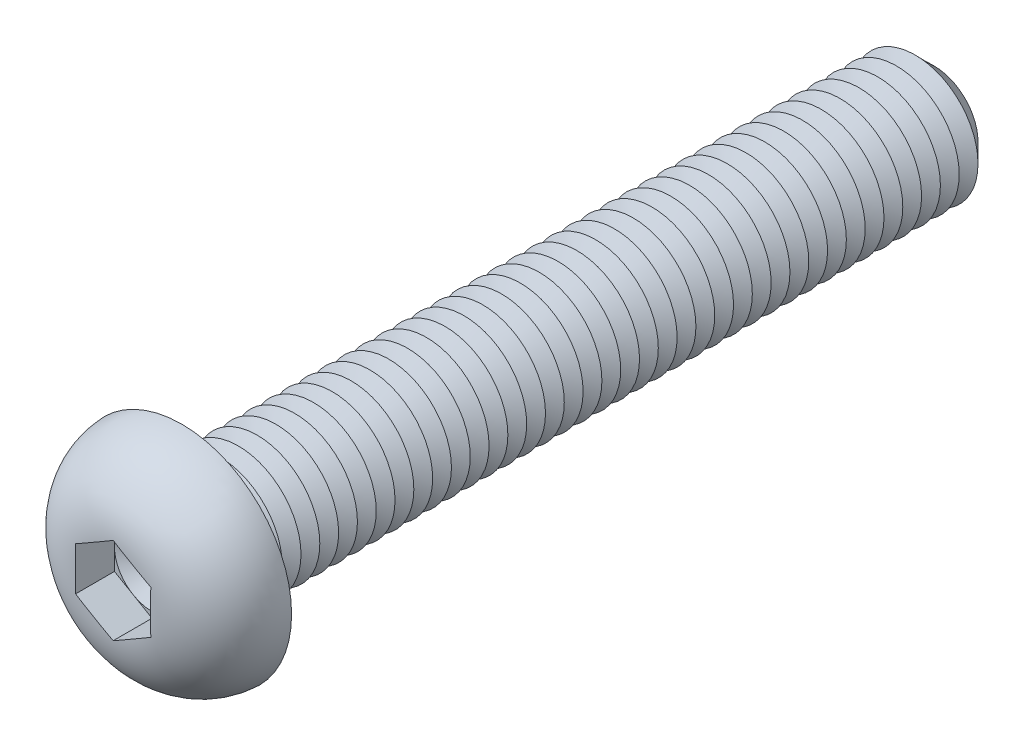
ISO-10303-21;
HEADER;
FILE_DESCRIPTION(('STEP AP214'),'2;1');
FILE_NAME('part.step','',(''),(''),'','','');
FILE_SCHEMA(('AUTOMOTIVE_DESIGN { 1 0 10303 214 1 1 1 1 }'));
ENDSEC;
DATA;
#1=APPLICATION_CONTEXT('core data for automotive mechanical design processes');
#2=APPLICATION_PROTOCOL_DEFINITION('international standard','automotive_design',2000,#1);
#3=PRODUCT_CONTEXT('',#1,'mechanical');
#4=PRODUCT('Part','Part','',(#3));
#5=PRODUCT_RELATED_PRODUCT_CATEGORY('part','',(#4));
#6=PRODUCT_DEFINITION_FORMATION('','',#4);
#7=PRODUCT_DEFINITION_CONTEXT('part definition',#1,'design');
#8=PRODUCT_DEFINITION('design','',#6,#7);
#9=PRODUCT_DEFINITION_SHAPE('','',#8);
#10=(LENGTH_UNIT() NAMED_UNIT(*) SI_UNIT(.MILLI.,.METRE.));
#11=(NAMED_UNIT(*) PLANE_ANGLE_UNIT() SI_UNIT($,.RADIAN.));
#12=(NAMED_UNIT(*) SI_UNIT($,.STERADIAN.) SOLID_ANGLE_UNIT());
#13=UNCERTAINTY_MEASURE_WITH_UNIT(LENGTH_MEASURE(1.E-05),#10,'distance_accuracy_value','');
#14=(GEOMETRIC_REPRESENTATION_CONTEXT(3) GLOBAL_UNCERTAINTY_ASSIGNED_CONTEXT((#13)) GLOBAL_UNIT_ASSIGNED_CONTEXT((#10,
#11,#12)) REPRESENTATION_CONTEXT('',''));
#15=CARTESIAN_POINT('',(0.,0.,0.));
#16=DIRECTION('',(0.,0.,1.));
#17=DIRECTION('',(1.,0.,0.));
#18=AXIS2_PLACEMENT_3D('',#15,#16,#17);
#19=CARTESIAN_POINT('',(0.,0.,2.38));
#20=DIRECTION('',(0.,0.,1.));
#21=DIRECTION('',(1.,0.,0.));
#22=AXIS2_PLACEMENT_3D('',#19,#20,#21);
#23=PLANE('',#22);
#24=CARTESIAN_POINT('',(0.,0.,2.38));
#25=DIRECTION('',(0.,0.,1.));
#26=DIRECTION('',(1.,0.,0.));
#27=AXIS2_PLACEMENT_3D('',#24,#25,#26);
#28=CIRCLE('',#27,3.);
#29=CARTESIAN_POINT('',(3.,0.,2.38));
#30=VERTEX_POINT('',#29);
#31=CARTESIAN_POINT('',(1.5,2.59807621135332,2.38));
#32=VERTEX_POINT('',#31);
#33=EDGE_CURVE('E117',#30,#32,#28,.T.);
#34=ORIENTED_EDGE('',*,*,#33,.F.);
#35=DIRECTION('',(0.,1.,0.));
#36=VECTOR('',#35,1.);
#37=CARTESIAN_POINT('',(3.,-1.73205080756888,2.38));
#38=LINE('',#37,#36);
#39=CARTESIAN_POINT('',(3.,1.73205080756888,2.38));
#40=VERTEX_POINT('',#39);
#41=EDGE_CURVE('E140',#30,#40,#38,.T.);
#42=ORIENTED_EDGE('',*,*,#41,.T.);
#43=DIRECTION('',(-0.866025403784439,0.5,0.));
#44=VECTOR('',#43,1.);
#45=CARTESIAN_POINT('',(3.,1.73205080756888,2.38));
#46=LINE('',#45,#44);
#47=EDGE_CURVE('E136',#40,#32,#46,.T.);
#48=ORIENTED_EDGE('',*,*,#47,.T.);
#49=EDGE_LOOP('',(#34,#42,#48));
#50=FACE_BOUND('',#49,.T.);
#51=ADVANCED_FACE('F39',(#50),#23,.T.);
#52=CARTESIAN_POINT('',(0.,0.,2.38));
#53=DIRECTION('',(0.,0.,1.));
#54=DIRECTION('',(1.,0.,0.));
#55=AXIS2_PLACEMENT_3D('',#52,#53,#54);
#56=CIRCLE('',#55,3.);
#57=CARTESIAN_POINT('',(-1.5,2.59807621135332,2.38));
#58=VERTEX_POINT('',#57);
#59=EDGE_CURVE('E11',#32,#58,#56,.T.);
#60=ORIENTED_EDGE('',*,*,#59,.F.);
#61=CARTESIAN_POINT('',(0.,3.46410161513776,2.38));
#62=VERTEX_POINT('',#61);
#63=EDGE_CURVE('E130',#32,#62,#46,.T.);
#64=ORIENTED_EDGE('',*,*,#63,.T.);
#65=DIRECTION('',(-0.866025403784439,-0.5,0.));
#66=VECTOR('',#65,1.);
#67=CARTESIAN_POINT('',(0.,3.46410161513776,2.38));
#68=LINE('',#67,#66);
#69=EDGE_CURVE('E131',#62,#58,#68,.T.);
#70=ORIENTED_EDGE('',*,*,#69,.T.);
#71=EDGE_LOOP('',(#60,#64,#70));
#72=FACE_BOUND('',#71,.T.);
#73=ADVANCED_FACE('F129',(#72),#23,.T.);
#74=CARTESIAN_POINT('',(-3.,0.,2.38));
#75=VERTEX_POINT('',#74);
#76=EDGE_CURVE('E49',#58,#75,#56,.T.);
#77=ORIENTED_EDGE('',*,*,#76,.F.);
#78=CARTESIAN_POINT('',(-3.,1.73205080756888,2.38));
#79=VERTEX_POINT('',#78);
#80=EDGE_CURVE('E143',#58,#79,#68,.T.);
#81=ORIENTED_EDGE('',*,*,#80,.T.);
#82=DIRECTION('',(0.,-1.,0.));
#83=VECTOR('',#82,1.);
#84=CARTESIAN_POINT('',(-3.,1.73205080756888,2.38));
#85=LINE('',#84,#83);
#86=EDGE_CURVE('E153',#79,#75,#85,.T.);
#87=ORIENTED_EDGE('',*,*,#86,.T.);
#88=EDGE_LOOP('',(#77,#81,#87));
#89=FACE_BOUND('',#88,.T.);
#90=ADVANCED_FACE('F271',(#89),#23,.T.);
#91=CARTESIAN_POINT('',(-1.5,-2.59807621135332,2.38));
#92=VERTEX_POINT('',#91);
#93=EDGE_CURVE('E254',#75,#92,#56,.T.);
#94=ORIENTED_EDGE('',*,*,#93,.F.);
#95=CARTESIAN_POINT('',(-3.,-1.73205080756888,2.38));
#96=VERTEX_POINT('',#95);
#97=EDGE_CURVE('E152',#75,#96,#85,.T.);
#98=ORIENTED_EDGE('',*,*,#97,.T.);
#99=DIRECTION('',(0.866025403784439,-0.5,0.));
#100=VECTOR('',#99,1.);
#101=CARTESIAN_POINT('',(-3.,-1.73205080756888,2.38));
#102=LINE('',#101,#100);
#103=EDGE_CURVE('E158',#96,#92,#102,.T.);
#104=ORIENTED_EDGE('',*,*,#103,.T.);
#105=EDGE_LOOP('',(#94,#98,#104));
#106=FACE_BOUND('',#105,.T.);
#107=ADVANCED_FACE('F265',(#106),#23,.T.);
#108=CARTESIAN_POINT('',(1.5,-2.59807621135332,2.38));
#109=VERTEX_POINT('',#108);
#110=EDGE_CURVE('E56',#92,#109,#56,.T.);
#111=ORIENTED_EDGE('',*,*,#110,.F.);
#112=CARTESIAN_POINT('',(0.,-3.46410161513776,2.38));
#113=VERTEX_POINT('',#112);
#114=EDGE_CURVE('E157',#92,#113,#102,.T.);
#115=ORIENTED_EDGE('',*,*,#114,.T.);
#116=DIRECTION('',(0.866025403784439,0.5,0.));
#117=VECTOR('',#116,1.);
#118=CARTESIAN_POINT('',(0.,-3.46410161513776,2.38));
#119=LINE('',#118,#117);
#120=EDGE_CURVE('E163',#113,#109,#119,.T.);
#121=ORIENTED_EDGE('',*,*,#120,.T.);
#122=EDGE_LOOP('',(#111,#115,#121));
#123=FACE_BOUND('',#122,.T.);
#124=ADVANCED_FACE('F304',(#123),#23,.T.);
#125=CARTESIAN_POINT('',(0.,0.,-60.));
#126=DIRECTION('',(0.,0.,1.));
#127=DIRECTION('',(1.,0.,0.));
#128=AXIS2_PLACEMENT_3D('',#125,#126,#127);
#129=CYLINDRICAL_SURFACE('',#128,5.);
#130=CARTESIAN_POINT('',(0.,0.,-0.600000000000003));
#131=DIRECTION('',(0.,0.,1.));
#132=DIRECTION('',(1.,0.,0.));
#133=AXIS2_PLACEMENT_3D('',#130,#131,#132);
#134=CIRCLE('',#133,5.);
#135=CARTESIAN_POINT('',(5.,0.,-0.600000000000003));
#136=VERTEX_POINT('',#135);
#137=EDGE_CURVE('E242',#136,#136,#134,.F.);
#138=ORIENTED_EDGE('',*,*,#137,.T.);
#139=EDGE_LOOP('',(#138));
#140=FACE_BOUND('',#139,.T.);
#141=CARTESIAN_POINT('',(0.,0.,-1.5));
#142=DIRECTION('',(0.,0.,1.));
#143=DIRECTION('',(1.,0.,0.));
#144=AXIS2_PLACEMENT_3D('',#141,#142,#143);
#145=CIRCLE('',#144,5.00000000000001);
#146=CARTESIAN_POINT('',(5.00000000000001,0.,-1.5));
#147=VERTEX_POINT('',#146);
#148=EDGE_CURVE('E138',#147,#147,#145,.T.);
#149=ORIENTED_EDGE('',*,*,#148,.T.);
#150=EDGE_LOOP('',(#149));
#151=FACE_BOUND('',#150,.T.);
#152=ADVANCED_FACE('F305',(#140,#151),#129,.T.);
#153=CARTESIAN_POINT('',(0.,8.75,0.));
#154=DIRECTION('',(0.,0.,1.));
#155=DIRECTION('',(1.,0.,0.));
#156=AXIS2_PLACEMENT_3D('',#153,#154,#155);
#157=PLANE('',#156);
#158=CARTESIAN_POINT('',(0.,0.,0.));
#159=DIRECTION('',(0.,0.,1.));
#160=DIRECTION('',(1.,0.,0.));
#161=AXIS2_PLACEMENT_3D('',#158,#159,#160);
#162=CIRCLE('',#161,5.6);
#163=CARTESIAN_POINT('',(5.6,0.,0.));
#164=VERTEX_POINT('',#163);
#165=EDGE_CURVE('E244',#164,#164,#162,.T.);
#166=ORIENTED_EDGE('',*,*,#165,.T.);
#167=EDGE_LOOP('',(#166));
#168=FACE_BOUND('',#167,.T.);
#169=CARTESIAN_POINT('',(0.,0.,0.));
#170=DIRECTION('',(0.,0.,1.));
#171=DIRECTION('',(1.,0.,0.));
#172=AXIS2_PLACEMENT_3D('',#169,#170,#171);
#173=CIRCLE('',#172,8.75);
#174=CARTESIAN_POINT('',(8.75,0.,0.));
#175=VERTEX_POINT('',#174);
#176=EDGE_CURVE('E174',#175,#175,#173,.T.);
#177=ORIENTED_EDGE('',*,*,#176,.F.);
#178=EDGE_LOOP('',(#177));
#179=FACE_BOUND('',#178,.T.);
#180=ADVANCED_FACE('F308',(#168,#179),#157,.F.);
#181=CARTESIAN_POINT('',(0.,0.,-0.3));
#182=DIRECTION('',(0.,0.,1.));
#183=DIRECTION('',(1.,0.,0.));
#184=AXIS2_PLACEMENT_3D('',#181,#182,#183);
#185=DEGENERATE_TOROIDAL_SURFACE('',#184,2.95776381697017,5.8,.T.);
#186=CARTESIAN_POINT('',(-3.0002,1.73193533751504,5.47784605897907));
#187=CARTESIAN_POINT('',(-2.87524340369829,1.80407906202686,5.4841525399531));
#188=CARTESIAN_POINT('',(-2.75023731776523,1.87625135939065,5.48853670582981));
#189=CARTESIAN_POINT('',(-2.5001955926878,2.02061301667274,5.49472046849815));
#190=CARTESIAN_POINT('',(-2.37515996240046,2.09280237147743,5.49652051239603));
#191=CARTESIAN_POINT('',(-2.12510741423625,2.23717027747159,5.4987972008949));
#192=CARTESIAN_POINT('',(-2.00009049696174,2.30934882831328,5.49927407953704));
#193=CARTESIAN_POINT('',(-1.75004905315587,2.45371032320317,5.49979859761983));
#194=CARTESIAN_POINT('',(-1.62502452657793,2.52589326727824,5.49984621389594));
#195=CARTESIAN_POINT('',(-1.37497547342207,2.67025915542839,5.49984621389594));
#196=CARTESIAN_POINT('',(-1.24995094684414,2.74244209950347,5.49979859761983));
#197=CARTESIAN_POINT('',(-0.999909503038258,2.88680359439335,5.49927407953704));
#198=CARTESIAN_POINT('',(-0.874892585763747,2.95898214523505,5.4987972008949));
#199=CARTESIAN_POINT('',(-0.624840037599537,3.10335005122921,5.49652051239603));
#200=CARTESIAN_POINT('',(-0.499804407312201,3.1755394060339,5.49472046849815));
#201=CARTESIAN_POINT('',(-0.249762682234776,3.31990106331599,5.48853670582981));
#202=CARTESIAN_POINT('',(-0.124756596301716,3.39207336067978,5.4841525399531));
#203=CARTESIAN_POINT('',(0.000199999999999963,3.46421708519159,5.47784605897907));
#204=B_SPLINE_CURVE_WITH_KNOTS('',3,(#186,#187,#188,#189,#190,#191,#192,#193,#194,#195,#196,
#197,#198,#199,#200,#201,#202,#203),.UNSPECIFIED.,.F.,.F.,(4,2,2,2,2,2,2,2,4),(0.,
0.433225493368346,0.866376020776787,1.29944992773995,1.73254720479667,2.16564448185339,
2.59871838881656,3.031868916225,3.46509440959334),.UNSPECIFIED.);
#205=CARTESIAN_POINT('',(-3.,1.73205080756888,5.4778561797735));
#206=VERTEX_POINT('',#205);
#207=CARTESIAN_POINT('',(0.,3.46410161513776,5.4778561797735));
#208=VERTEX_POINT('',#207);
#209=EDGE_CURVE('E196',#206,#208,#204,.T.);
#210=ORIENTED_EDGE('',*,*,#209,.T.);
#211=CARTESIAN_POINT('',(-0.000200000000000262,3.46421708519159,5.47784605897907));
#212=CARTESIAN_POINT('',(0.124756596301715,3.39207336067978,5.4841525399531));
#213=CARTESIAN_POINT('',(0.249762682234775,3.31990106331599,5.48853670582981));
#214=CARTESIAN_POINT('',(0.4998044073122,3.1755394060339,5.49472046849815));
#215=CARTESIAN_POINT('',(0.624840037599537,3.10335005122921,5.49652051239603));
#216=CARTESIAN_POINT('',(0.874892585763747,2.95898214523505,5.4987972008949));
#217=CARTESIAN_POINT('',(0.999909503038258,2.88680359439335,5.49927407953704));
#218=CARTESIAN_POINT('',(1.24995094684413,2.74244209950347,5.49979859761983));
#219=CARTESIAN_POINT('',(1.37497547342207,2.67025915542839,5.49984621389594));
#220=CARTESIAN_POINT('',(1.62502452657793,2.52589326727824,5.49984621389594));
#221=CARTESIAN_POINT('',(1.75004905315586,2.45371032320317,5.49979859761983));
#222=CARTESIAN_POINT('',(2.00009049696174,2.30934882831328,5.49927407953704));
#223=CARTESIAN_POINT('',(2.12510741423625,2.23717027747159,5.4987972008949));
#224=CARTESIAN_POINT('',(2.37515996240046,2.09280237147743,5.49652051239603));
#225=CARTESIAN_POINT('',(2.5001955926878,2.02061301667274,5.49472046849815));
#226=CARTESIAN_POINT('',(2.75023731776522,1.87625135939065,5.48853670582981));
#227=CARTESIAN_POINT('',(2.87524340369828,1.80407906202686,5.4841525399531));
#228=CARTESIAN_POINT('',(3.0002,1.73193533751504,5.47784605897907));
#229=B_SPLINE_CURVE_WITH_KNOTS('',3,(#211,#212,#213,#214,#215,#216,#217,#218,#219,#220,#221,
#222,#223,#224,#225,#226,#227,#228),.UNSPECIFIED.,.F.,.F.,(4,2,2,2,2,2,2,2,4),(0.,
0.433225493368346,0.866376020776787,1.29944992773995,1.73254720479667,2.16564448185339,
2.59871838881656,3.031868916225,3.46509440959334),.UNSPECIFIED.);
#230=CARTESIAN_POINT('',(3.,1.73205080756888,5.47785617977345));
#231=VERTEX_POINT('',#230);
#232=EDGE_CURVE('E225',#208,#231,#229,.T.);
#233=ORIENTED_EDGE('',*,*,#232,.T.);
#234=CARTESIAN_POINT('',(3.,0.,5.49984621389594));
#235=CARTESIAN_POINT('',(3.,-0.125570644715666,5.49984449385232));
#236=CARTESIAN_POINT('',(3.,-0.251141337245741,5.49980426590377));
#237=CARTESIAN_POINT('',(3.,-0.502283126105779,5.499449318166));
#238=CARTESIAN_POINT('',(3.,-0.62785422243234,5.49913459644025));
#239=CARTESIAN_POINT('',(3.,-0.879037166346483,5.49770394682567));
#240=CARTESIAN_POINT('',(3.,-1.00464901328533,5.49658774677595));
#241=CARTESIAN_POINT('',(3.,-1.2558477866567,5.49279605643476));
#242=CARTESIAN_POINT('',(3.,-1.38143471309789,5.49012056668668));
#243=CARTESIAN_POINT('',(3.,-1.7568847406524,5.47847778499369));
#244=CARTESIAN_POINT('',(3.,-2.00667103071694,5.46590367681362));
#245=CARTESIAN_POINT('',(3.,-2.50488375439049,5.42441448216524));
#246=CARTESIAN_POINT('',(3.,-2.75331093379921,5.3955095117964));
#247=CARTESIAN_POINT('',(3.,-3.18719021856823,5.32582626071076));
#248=CARTESIAN_POINT('',(3.,-3.3733635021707,5.28960049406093));
#249=CARTESIAN_POINT('',(3.,-3.74245496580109,5.20330651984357));
#250=CARTESIAN_POINT('',(3.,-3.92537417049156,5.15324275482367));
#251=CARTESIAN_POINT('',(3.,-4.28675502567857,5.03819885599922));
#252=CARTESIAN_POINT('',(3.,-4.46521058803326,4.97319946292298));
#253=CARTESIAN_POINT('',(3.,-4.81576789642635,4.82782766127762));
#254=CARTESIAN_POINT('',(3.,-4.98786985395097,4.74745576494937));
#255=CARTESIAN_POINT('',(3.,-5.3254008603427,4.5705398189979));
#256=CARTESIAN_POINT('',(3.,-5.49076268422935,4.47386710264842));
#257=CARTESIAN_POINT('',(3.,-5.81151175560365,4.26514040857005));
#258=CARTESIAN_POINT('',(3.,-5.96689840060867,4.15308550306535));
#259=CARTESIAN_POINT('',(3.,-6.26591787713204,3.91428862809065));
#260=CARTESIAN_POINT('',(3.,-6.40955257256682,3.78754899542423));
#261=CARTESIAN_POINT('',(3.,-6.68342295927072,3.52034797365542));
#262=CARTESIAN_POINT('',(3.,-6.81366070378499,3.3798886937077));
#263=CARTESIAN_POINT('',(3.,-7.0426666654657,3.10626157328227));
#264=CARTESIAN_POINT('',(3.,-7.1433109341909,2.97465879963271));
#265=CARTESIAN_POINT('',(3.,-7.33253056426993,2.70304716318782));
#266=CARTESIAN_POINT('',(3.,-7.42110686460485,2.56303895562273));
#267=CARTESIAN_POINT('',(3.,-7.58534868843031,2.27573732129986));
#268=CARTESIAN_POINT('',(3.,-7.66102067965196,2.12844759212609));
#269=CARTESIAN_POINT('',(3.,-7.79881901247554,1.82765987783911));
#270=CARTESIAN_POINT('',(3.,-7.86094563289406,1.67416202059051));
#271=CARTESIAN_POINT('',(3.,-7.96803488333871,1.37082076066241));
#272=CARTESIAN_POINT('',(3.,-8.01375687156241,1.22124490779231));
#273=CARTESIAN_POINT('',(3.,-8.09224398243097,0.918674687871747));
#274=CARTESIAN_POINT('',(3.,-8.12500479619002,0.765679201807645));
#275=CARTESIAN_POINT('',(3.,-8.17726457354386,0.457507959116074));
#276=CARTESIAN_POINT('',(3.,-8.1967692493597,0.302333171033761));
#277=CARTESIAN_POINT('',(3.,-8.22238322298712,-0.00917738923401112));
#278=CARTESIAN_POINT('',(3.,-8.22848754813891,-0.165513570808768));
#279=CARTESIAN_POINT('',(3.,-8.22724693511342,-0.475358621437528));
#280=CARTESIAN_POINT('',(3.,-8.2201384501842,-0.628868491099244));
#281=CARTESIAN_POINT('',(3.,-8.1929851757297,-0.934809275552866));
#282=CARTESIAN_POINT('',(3.,-8.17293462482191,-1.0872396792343));
#283=CARTESIAN_POINT('',(3.,-8.1200547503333,-1.38984943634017));
#284=CARTESIAN_POINT('',(3.,-8.08722683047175,-1.54002903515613));
#285=CARTESIAN_POINT('',(3.,-8.0090712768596,-1.83702738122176));
#286=CARTESIAN_POINT('',(3.,-7.96374919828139,-1.98384759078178));
#287=CARTESIAN_POINT('',(3.,-7.86096457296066,-2.27315566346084));
#288=CARTESIAN_POINT('',(3.,-7.80350334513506,-2.41564399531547));
#289=CARTESIAN_POINT('',(3.,-7.67691451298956,-2.6952770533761));
#290=CARTESIAN_POINT('',(3.,-7.60779108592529,-2.83242367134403));
#291=CARTESIAN_POINT('',(3.,-7.45837210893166,-3.10056990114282));
#292=CARTESIAN_POINT('',(3.,-7.37807144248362,-3.23156666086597));
#293=CARTESIAN_POINT('',(3.,-7.20697634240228,-3.48645411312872));
#294=CARTESIAN_POINT('',(3.,-7.11618520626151,-3.61034702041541));
#295=CARTESIAN_POINT('',(3.,-6.92334779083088,-3.85210954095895));
#296=CARTESIAN_POINT('',(3.,-6.82115263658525,-3.96986038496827));
#297=CARTESIAN_POINT('',(3.,-6.60745266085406,-4.19658717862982));
#298=CARTESIAN_POINT('',(3.,-6.49594754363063,-4.30556284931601));
#299=CARTESIAN_POINT('',(3.,-6.26450055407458,-4.51413072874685));
#300=CARTESIAN_POINT('',(3.,-6.14455919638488,-4.61372350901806));
#301=CARTESIAN_POINT('',(3.,-5.8971402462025,-4.80306090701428));
#302=CARTESIAN_POINT('',(3.,-5.76966228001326,-4.89280503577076));
#303=CARTESIAN_POINT('',(3.,-5.50268934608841,-5.06561354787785));
#304=CARTESIAN_POINT('',(3.,-5.36291526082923,-5.14824654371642));
#305=CARTESIAN_POINT('',(3.,-5.07726499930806,-5.30226841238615));
#306=CARTESIAN_POINT('',(3.,-4.93138704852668,-5.37365398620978));
#307=CARTESIAN_POINT('',(3.,-4.63484455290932,-5.50505544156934));
#308=CARTESIAN_POINT('',(3.,-4.48418671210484,-5.56508649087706));
#309=CARTESIAN_POINT('',(3.,-4.17906596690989,-5.6740700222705));
#310=CARTESIAN_POINT('',(3.,-4.02460600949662,-5.72303080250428));
#311=CARTESIAN_POINT('',(3.,-3.6739247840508,-5.82125760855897));
#312=CARTESIAN_POINT('',(3.,-3.47687521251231,-5.86756841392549));
#313=CARTESIAN_POINT('',(3.,-3.07981530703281,-5.94521593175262));
#314=CARTESIAN_POINT('',(3.,-2.87980357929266,-5.97654534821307));
#315=CARTESIAN_POINT('',(3.,-2.47751859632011,-6.02656554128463));
#316=CARTESIAN_POINT('',(3.,-2.27523974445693,-6.0452096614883));
#317=CARTESIAN_POINT('',(3.,-1.8700786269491,-6.07274849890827));
#318=CARTESIAN_POINT('',(3.,-1.66719636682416,-6.08164330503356));
#319=CARTESIAN_POINT('',(3.,-1.25887867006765,-6.09343726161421));
#320=CARTESIAN_POINT('',(3.,-1.05344157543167,-6.09626381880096));
#321=CARTESIAN_POINT('',(3.,-0.745285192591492,-6.0985660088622));
#322=CARTESIAN_POINT('',(3.,-0.642567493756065,-6.09901047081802));
#323=CARTESIAN_POINT('',(3.,-0.437131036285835,-6.09957976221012));
#324=CARTESIAN_POINT('',(3.,-0.334412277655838,-6.09970459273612));
#325=CARTESIAN_POINT('',(3.,-0.129132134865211,-6.09984385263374));
#326=CARTESIAN_POINT('',(3.,-0.0265707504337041,-6.09985845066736));
#327=CARTESIAN_POINT('',(3.,0.178552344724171,-6.09981980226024));
#328=CARTESIAN_POINT('',(3.,0.281114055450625,-6.09976655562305));
#329=CARTESIAN_POINT('',(3.,0.486235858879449,-6.09946703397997));
#330=CARTESIAN_POINT('',(3.,0.588795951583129,-6.0992207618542));
#331=CARTESIAN_POINT('',(3.,0.793913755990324,-6.09826017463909));
#332=CARTESIAN_POINT('',(3.,0.896471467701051,-6.097545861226));
#333=CARTESIAN_POINT('',(3.,1.11088851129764,-6.0951586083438));
#334=CARTESIAN_POINT('',(3.,1.22274716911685,-6.0934045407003));
#335=CARTESIAN_POINT('',(3.,1.44642575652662,-6.08829151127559));
#336=CARTESIAN_POINT('',(3.,1.55824568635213,-6.08493255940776));
#337=CARTESIAN_POINT('',(3.,1.89360474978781,-6.07150074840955));
#338=CARTESIAN_POINT('',(3.,2.11703989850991,-6.05807293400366));
#339=CARTESIAN_POINT('',(3.,2.56083256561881,-6.01778675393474));
#340=CARTESIAN_POINT('',(3.,2.78120000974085,-5.99104517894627));
#341=CARTESIAN_POINT('',(3.,3.2192866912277,-5.92065658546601));
#342=CARTESIAN_POINT('',(3.,3.43700630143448,-5.8770119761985));
#343=CARTESIAN_POINT('',(3.,3.82666678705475,-5.78060449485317));
#344=CARTESIAN_POINT('',(3.,3.99942726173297,-5.73116262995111));
#345=CARTESIAN_POINT('',(3.,4.3405567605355,-5.61888897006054));
#346=CARTESIAN_POINT('',(3.,4.50892617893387,-5.55605838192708));
#347=CARTESIAN_POINT('',(3.,4.84049143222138,-5.41635874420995));
#348=CARTESIAN_POINT('',(3.,5.00366586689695,-5.33943871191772));
#349=CARTESIAN_POINT('',(3.,5.32271829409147,-5.17167128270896));
#350=CARTESIAN_POINT('',(3.,5.47859600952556,-5.0808233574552));
#351=CARTESIAN_POINT('',(3.,5.7822829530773,-4.88500135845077));
#352=CARTESIAN_POINT('',(3.,5.93005015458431,-4.77996197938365));
#353=CARTESIAN_POINT('',(3.,6.21523046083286,-4.55663689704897));
#354=CARTESIAN_POINT('',(3.,6.35264336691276,-4.43835093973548));
#355=CARTESIAN_POINT('',(3.,6.61552762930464,-4.18948618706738));
#356=CARTESIAN_POINT('',(3.,6.74101380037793,-4.05892305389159));
#357=CARTESIAN_POINT('',(3.,6.97891308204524,-3.78639059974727));
#358=CARTESIAN_POINT('',(3.,7.09132750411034,-3.64442242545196));
#359=CARTESIAN_POINT('',(3.,7.29113623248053,-3.36530209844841));
#360=CARTESIAN_POINT('',(3.,7.37991316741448,-3.22913733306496));
#361=CARTESIAN_POINT('',(3.,7.5451968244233,-2.94955428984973));
#362=CARTESIAN_POINT('',(3.,7.62170419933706,-2.80613639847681));
#363=CARTESIAN_POINT('',(3.,7.76177641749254,-2.5131168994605));
#364=CARTESIAN_POINT('',(3.,7.82534152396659,-2.36351541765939));
#365=CARTESIAN_POINT('',(3.,7.93897019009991,-2.05926799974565));
#366=CARTESIAN_POINT('',(3.,7.98903395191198,-1.9046221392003));
#367=CARTESIAN_POINT('',(3.,8.07336540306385,-1.59821781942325));
#368=CARTESIAN_POINT('',(3.,8.10821878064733,-1.44662026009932));
#369=CARTESIAN_POINT('',(3.,8.16487862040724,-1.14095089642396));
#370=CARTESIAN_POINT('',(3.,8.18668070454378,-0.986878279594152));
#371=CARTESIAN_POINT('',(3.,8.21703234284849,-0.677515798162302));
#372=CARTESIAN_POINT('',(3.,8.22558889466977,-0.522226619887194));
#373=CARTESIAN_POINT('',(3.,8.22940229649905,-0.211427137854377));
#374=CARTESIAN_POINT('',(3.,8.22465425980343,-0.0559167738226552));
#375=CARTESIAN_POINT('',(3.,8.20204101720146,0.252033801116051));
#376=CARTESIAN_POINT('',(3.,8.18435378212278,0.404487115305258));
#377=CARTESIAN_POINT('',(3.,8.136196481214,0.707418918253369));
#378=CARTESIAN_POINT('',(3.,8.1057217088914,0.857896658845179));
#379=CARTESIAN_POINT('',(3.,8.03224632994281,1.15569567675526));
#380=CARTESIAN_POINT('',(3.,7.9892508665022,1.30301822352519));
#381=CARTESIAN_POINT('',(3.,7.89104818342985,1.59360769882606));
#382=CARTESIAN_POINT('',(3.,7.83583549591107,1.73687277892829));
#383=CARTESIAN_POINT('',(3.,7.71349498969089,2.01864020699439));
#384=CARTESIAN_POINT('',(3.,7.64633814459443,2.1571299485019));
#385=CARTESIAN_POINT('',(3.,7.50076383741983,2.42797950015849));
#386=CARTESIAN_POINT('',(3.,7.42235122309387,2.56034191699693));
#387=CARTESIAN_POINT('',(3.,7.25483284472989,2.8181715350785));
#388=CARTESIAN_POINT('',(3.,7.16572386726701,2.94363664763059));
#389=CARTESIAN_POINT('',(3.,6.9775559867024,3.1867979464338));
#390=CARTESIAN_POINT('',(3.,6.87850037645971,3.30449668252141));
#391=CARTESIAN_POINT('',(3.,6.66919743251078,3.53363644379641));
#392=CARTESIAN_POINT('',(3.,6.55877281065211,3.6449154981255));
#393=CARTESIAN_POINT('',(3.,6.32925753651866,3.85806320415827));
#394=CARTESIAN_POINT('',(3.,6.21016952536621,3.95993470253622));
#395=CARTESIAN_POINT('',(3.,5.96413069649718,4.15386505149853));
#396=CARTESIAN_POINT('',(3.,5.83717459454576,4.24591719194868));
#397=CARTESIAN_POINT('',(3.,5.5764653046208,4.41973423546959));
#398=CARTESIAN_POINT('',(3.,5.4427139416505,4.50150188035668));
#399=CARTESIAN_POINT('',(3.,5.16249709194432,4.65840017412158));
#400=CARTESIAN_POINT('',(3.,5.01573037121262,4.73299250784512));
#401=CARTESIAN_POINT('',(3.,4.71685583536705,4.87057528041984));
#402=CARTESIAN_POINT('',(3.,4.56474751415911,4.93356461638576));
#403=CARTESIAN_POINT('',(3.,4.25657035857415,5.04801407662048));
#404=CARTESIAN_POINT('',(3.,4.10050882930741,5.09949395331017));
#405=CARTESIAN_POINT('',(3.,3.78523286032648,5.19149003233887));
#406=CARTESIAN_POINT('',(3.,3.62601895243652,5.23200806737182));
#407=CARTESIAN_POINT('',(3.,3.32461902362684,5.29856444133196));
#408=CARTESIAN_POINT('',(3.,3.18268434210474,5.32575733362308));
#409=CARTESIAN_POINT('',(3.,2.89760844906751,5.3729307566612));
#410=CARTESIAN_POINT('',(3.,2.75446703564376,5.39291005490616));
#411=CARTESIAN_POINT('',(3.,2.46730946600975,5.42656527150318));
#412=CARTESIAN_POINT('',(3.,2.32329255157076,5.44023457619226));
#413=CARTESIAN_POINT('',(3.,2.03487642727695,5.46234228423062));
#414=CARTESIAN_POINT('',(3.,1.89047722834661,5.4707808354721));
#415=CARTESIAN_POINT('',(3.,1.60058090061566,5.48373897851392));
#416=CARTESIAN_POINT('',(3.,1.45508270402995,5.48823290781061));
#417=CARTESIAN_POINT('',(3.,1.16402671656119,5.49458098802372));
#418=CARTESIAN_POINT('',(3.,1.01846892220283,5.49643495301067));
#419=CARTESIAN_POINT('',(3.,0.72742451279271,5.49877506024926));
#420=CARTESIAN_POINT('',(3.,0.581937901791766,5.49926194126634));
#421=CARTESIAN_POINT('',(3.,0.290967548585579,5.49979850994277));
#422=CARTESIAN_POINT('',(3.,0.145483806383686,5.49984820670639));
#423=CARTESIAN_POINT('',(3.,0.,5.49984621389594));
#424=B_SPLINE_CURVE_WITH_KNOTS('',3,(#234,#235,#236,#237,#238,#239,#240,#241,#242,#243,#244,
#245,#246,#247,#248,#249,#250,#251,#252,#253,#254,#255,#256,#257,#258,#259,#260,#261,#262,#263,
#264,#265,#266,#267,#268,#269,#270,#271,#272,#273,#274,#275,#276,#277,#278,#279,#280,#281,#282,
#283,#284,#285,#286,#287,#288,#289,#290,#291,#292,#293,#294,#295,#296,#297,#298,#299,#300,#301,
#302,#303,#304,#305,#306,#307,#308,#309,#310,#311,#312,#313,#314,#315,#316,#317,#318,#319,#320,
#321,#322,#323,#324,#325,#326,#327,#328,#329,#330,#331,#332,#333,#334,#335,#336,#337,#338,#339,
#340,#341,#342,#343,#344,#345,#346,#347,#348,#349,#350,#351,#352,#353,#354,#355,#356,#357,#358,
#359,#360,#361,#362,#363,#364,#365,#366,#367,#368,#369,#370,#371,#372,#373,#374,#375,#376,#377,
#378,#379,#380,#381,#382,#383,#384,#385,#386,#387,#388,#389,#390,#391,#392,#393,#394,#395,#396,
#397,#398,#399,#400,#401,#402,#403,#404,#405,#406,#407,#408,#409,#410,#411,#412,#413,#414,#415,
#416,#417,#418,#419,#420,#421,#422,#423),.UNSPECIFIED.,.T.,.F.,(4,2,2,2,2,2,2,2,2,2,2,2,2,2,2,2,
2,2,2,2,2,2,2,2,2,2,2,2,2,2,2,2,2,2,2,2,2,2,2,2,2,2,2,2,2,2,2,2,2,2,2,2,2,2,2,2,2,2,2,2,2,2,2,2,
2,2,2,2,2,2,2,2,2,2,2,2,2,2,2,2,2,2,2,2,2,2,2,2,2,2,2,2,2,2,4),(0.,0.376711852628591,
0.753426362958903,1.13026885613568,1.50711121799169,2.257095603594,3.00661592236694,
3.57514719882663,4.14349616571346,4.71258216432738,5.28164920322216,5.85543852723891,
6.42926247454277,7.00299523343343,7.57663992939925,8.07303876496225,8.56939895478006,
9.06550962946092,9.56161009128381,10.030267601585,10.4990807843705,10.9676918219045,
11.4364767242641,11.8969530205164,12.3576344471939,12.8182652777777,13.2786916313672,
13.7390679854,14.1992797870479,14.6597029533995,15.1199817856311,15.5871904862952,
16.0544140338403,16.5216091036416,16.9888273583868,17.4754224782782,17.9621600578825,
18.4482427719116,18.9339599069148,19.5405320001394,20.1473991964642,20.7564865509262,
21.3655683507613,21.9818967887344,22.2900536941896,22.5982095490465,22.905893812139,
23.2135789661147,23.5212595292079,23.8289389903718,24.1645461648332,24.5001512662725,
25.171371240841,25.8368042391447,26.5021424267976,27.0407309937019,27.5792710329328,
28.119799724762,28.660348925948,29.2034761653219,29.7466138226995,30.2890677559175,
30.831467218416,31.3185063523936,31.8055195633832,32.2925228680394,32.779518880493,
33.2456153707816,33.7118681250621,34.1778744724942,34.6440520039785,35.103935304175,
35.563988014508,36.0238520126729,36.4839222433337,36.9451261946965,37.4061321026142,
37.8672768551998,38.3282694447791,38.7980460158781,39.2676799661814,39.7376328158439,
40.207460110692,40.7008436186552,41.1942739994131,41.6868509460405,42.1793454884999,
42.6126940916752,43.0461167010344,43.479992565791,43.9138561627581,44.3505218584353,
44.7872183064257,45.2236787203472,45.6601300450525),.UNSPECIFIED.);
#425=CARTESIAN_POINT('',(3.,-1.73205080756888,5.4778561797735));
#426=VERTEX_POINT('',#425);
#427=EDGE_CURVE('E234',#231,#426,#424,.T.);
#428=ORIENTED_EDGE('',*,*,#427,.T.);
#429=CARTESIAN_POINT('',(3.0002,-1.73193533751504,5.47784605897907));
#430=CARTESIAN_POINT('',(2.87524340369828,-1.80407906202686,5.4841525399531));
#431=CARTESIAN_POINT('',(2.75023731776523,-1.87625135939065,5.48853670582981));
#432=CARTESIAN_POINT('',(2.5001955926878,-2.02061301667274,5.49472046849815));
#433=CARTESIAN_POINT('',(2.37515996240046,-2.09280237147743,5.49652051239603));
#434=CARTESIAN_POINT('',(2.12510741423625,-2.23717027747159,5.4987972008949));
#435=CARTESIAN_POINT('',(2.00009049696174,-2.30934882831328,5.49927407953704));
#436=CARTESIAN_POINT('',(1.75004905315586,-2.45371032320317,5.49979859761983));
#437=CARTESIAN_POINT('',(1.62502452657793,-2.52589326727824,5.49984621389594));
#438=CARTESIAN_POINT('',(1.37497547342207,-2.67025915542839,5.49984621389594));
#439=CARTESIAN_POINT('',(1.24995094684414,-2.74244209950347,5.49979859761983));
#440=CARTESIAN_POINT('',(0.999909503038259,-2.88680359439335,5.49927407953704));
#441=CARTESIAN_POINT('',(0.874892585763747,-2.95898214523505,5.4987972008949));
#442=CARTESIAN_POINT('',(0.624840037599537,-3.10335005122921,5.49652051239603));
#443=CARTESIAN_POINT('',(0.499804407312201,-3.1755394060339,5.49472046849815));
#444=CARTESIAN_POINT('',(0.249762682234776,-3.31990106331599,5.48853670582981));
#445=CARTESIAN_POINT('',(0.124756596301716,-3.39207336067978,5.4841525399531));
#446=CARTESIAN_POINT('',(-0.000199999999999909,-3.46421708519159,5.47784605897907));
#447=B_SPLINE_CURVE_WITH_KNOTS('',3,(#429,#430,#431,#432,#433,#434,#435,#436,#437,#438,#439,
#440,#441,#442,#443,#444,#445,#446),.UNSPECIFIED.,.F.,.F.,(4,2,2,2,2,2,2,2,4),(0.,
0.433225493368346,0.866376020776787,1.29944992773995,1.73254720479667,2.16564448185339,
2.59871838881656,3.031868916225,3.46509440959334),.UNSPECIFIED.);
#448=CARTESIAN_POINT('',(0.,-3.46410161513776,5.4778561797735));
#449=VERTEX_POINT('',#448);
#450=EDGE_CURVE('E280',#426,#449,#447,.T.);
#451=ORIENTED_EDGE('',*,*,#450,.T.);
#452=CARTESIAN_POINT('',(0.000200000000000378,-3.46421708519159,5.47784605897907));
#453=CARTESIAN_POINT('',(-0.124756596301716,-3.39207336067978,5.4841525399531));
#454=CARTESIAN_POINT('',(-0.249762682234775,-3.31990106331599,5.48853670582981));
#455=CARTESIAN_POINT('',(-0.499804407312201,-3.1755394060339,5.49472046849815));
#456=CARTESIAN_POINT('',(-0.624840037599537,-3.10335005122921,5.49652051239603));
#457=CARTESIAN_POINT('',(-0.874892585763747,-2.95898214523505,5.4987972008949));
#458=CARTESIAN_POINT('',(-0.999909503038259,-2.88680359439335,5.49927407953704));
#459=CARTESIAN_POINT('',(-1.24995094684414,-2.74244209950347,5.49979859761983));
#460=CARTESIAN_POINT('',(-1.37497547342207,-2.67025915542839,5.49984621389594));
#461=CARTESIAN_POINT('',(-1.62502452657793,-2.52589326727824,5.49984621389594));
#462=CARTESIAN_POINT('',(-1.75004905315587,-2.45371032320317,5.49979859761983));
#463=CARTESIAN_POINT('',(-2.00009049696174,-2.30934882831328,5.49927407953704));
#464=CARTESIAN_POINT('',(-2.12510741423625,-2.23717027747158,5.4987972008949));
#465=CARTESIAN_POINT('',(-2.37515996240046,-2.09280237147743,5.49652051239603));
#466=CARTESIAN_POINT('',(-2.5001955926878,-2.02061301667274,5.49472046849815));
#467=CARTESIAN_POINT('',(-2.75023731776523,-1.87625135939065,5.48853670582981));
#468=CARTESIAN_POINT('',(-2.87524340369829,-1.80407906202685,5.4841525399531));
#469=CARTESIAN_POINT('',(-3.0002,-1.73193533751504,5.47784605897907));
#470=B_SPLINE_CURVE_WITH_KNOTS('',3,(#452,#453,#454,#455,#456,#457,#458,#459,#460,#461,#462,
#463,#464,#465,#466,#467,#468,#469),.UNSPECIFIED.,.F.,.F.,(4,2,2,2,2,2,2,2,4),(0.,
0.433225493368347,0.866376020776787,1.29944992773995,1.73254720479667,2.16564448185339,
2.59871838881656,3.031868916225,3.46509440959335),.UNSPECIFIED.);
#471=CARTESIAN_POINT('',(-3.,-1.73205080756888,5.47785617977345));
#472=VERTEX_POINT('',#471);
#473=EDGE_CURVE('E278',#449,#472,#470,.T.);
#474=ORIENTED_EDGE('',*,*,#473,.T.);
#475=CARTESIAN_POINT('',(-3.,0.,5.49984621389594));
#476=CARTESIAN_POINT('',(-3.,0.125570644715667,5.49984449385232));
#477=CARTESIAN_POINT('',(-3.,0.251141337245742,5.49980426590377));
#478=CARTESIAN_POINT('',(-3.,0.50228312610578,5.499449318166));
#479=CARTESIAN_POINT('',(-3.,0.627854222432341,5.49913459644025));
#480=CARTESIAN_POINT('',(-3.,0.879037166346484,5.49770394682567));
#481=CARTESIAN_POINT('',(-3.,1.00464901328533,5.49658774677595));
#482=CARTESIAN_POINT('',(-3.,1.2558477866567,5.49279605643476));
#483=CARTESIAN_POINT('',(-3.,1.3814347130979,5.49012056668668));
#484=CARTESIAN_POINT('',(-3.,1.7568847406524,5.47847778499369));
#485=CARTESIAN_POINT('',(-3.,2.00667103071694,5.46590367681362));
#486=CARTESIAN_POINT('',(-3.,2.50488375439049,5.42441448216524));
#487=CARTESIAN_POINT('',(-3.,2.75331093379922,5.3955095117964));
#488=CARTESIAN_POINT('',(-3.,3.18719021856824,5.32582626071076));
#489=CARTESIAN_POINT('',(-3.,3.3733635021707,5.28960049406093));
#490=CARTESIAN_POINT('',(-3.,3.74245496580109,5.20330651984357));
#491=CARTESIAN_POINT('',(-3.,3.92537417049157,5.15324275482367));
#492=CARTESIAN_POINT('',(-3.,4.28675502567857,5.03819885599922));
#493=CARTESIAN_POINT('',(-3.,4.46521058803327,4.97319946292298));
#494=CARTESIAN_POINT('',(-3.,4.81576789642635,4.82782766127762));
#495=CARTESIAN_POINT('',(-3.,4.98786985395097,4.74745576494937));
#496=CARTESIAN_POINT('',(-3.,5.3254008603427,4.5705398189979));
#497=CARTESIAN_POINT('',(-3.,5.49076268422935,4.47386710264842));
#498=CARTESIAN_POINT('',(-3.,5.81151175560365,4.26514040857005));
#499=CARTESIAN_POINT('',(-3.,5.96689840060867,4.15308550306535));
#500=CARTESIAN_POINT('',(-3.,6.26591787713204,3.91428862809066));
#501=CARTESIAN_POINT('',(-3.,6.40955257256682,3.78754899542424));
#502=CARTESIAN_POINT('',(-3.,6.68342295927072,3.52034797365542));
#503=CARTESIAN_POINT('',(-3.,6.81366070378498,3.3798886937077));
#504=CARTESIAN_POINT('',(-3.,7.0426666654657,3.10626157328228));
#505=CARTESIAN_POINT('',(-3.,7.14331093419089,2.97465879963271));
#506=CARTESIAN_POINT('',(-3.,7.33253056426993,2.70304716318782));
#507=CARTESIAN_POINT('',(-3.,7.42110686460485,2.56303895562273));
#508=CARTESIAN_POINT('',(-3.,7.58534868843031,2.27573732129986));
#509=CARTESIAN_POINT('',(-3.,7.66102067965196,2.12844759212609));
#510=CARTESIAN_POINT('',(-3.,7.79881901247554,1.82765987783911));
#511=CARTESIAN_POINT('',(-3.,7.86094563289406,1.67416202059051));
#512=CARTESIAN_POINT('',(-3.,7.96803488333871,1.37082076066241));
#513=CARTESIAN_POINT('',(-3.,8.01375687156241,1.22124490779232));
#514=CARTESIAN_POINT('',(-3.,8.09224398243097,0.918674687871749));
#515=CARTESIAN_POINT('',(-3.,8.12500479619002,0.765679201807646));
#516=CARTESIAN_POINT('',(-3.,8.17726457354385,0.457507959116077));
#517=CARTESIAN_POINT('',(-3.,8.1967692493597,0.302333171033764));
#518=CARTESIAN_POINT('',(-3.,8.22238322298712,-0.00917738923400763));
#519=CARTESIAN_POINT('',(-3.,8.22848754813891,-0.165513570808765));
#520=CARTESIAN_POINT('',(-3.,8.22724693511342,-0.475358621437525));
#521=CARTESIAN_POINT('',(-3.,8.2201384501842,-0.628868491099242));
#522=CARTESIAN_POINT('',(-3.,8.1929851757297,-0.934809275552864));
#523=CARTESIAN_POINT('',(-3.,8.17293462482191,-1.08723967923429));
#524=CARTESIAN_POINT('',(-3.,8.1200547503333,-1.38984943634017));
#525=CARTESIAN_POINT('',(-3.,8.08722683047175,-1.54002903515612));
#526=CARTESIAN_POINT('',(-3.,8.0090712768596,-1.83702738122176));
#527=CARTESIAN_POINT('',(-3.,7.96374919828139,-1.98384759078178));
#528=CARTESIAN_POINT('',(-3.,7.86096457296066,-2.27315566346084));
#529=CARTESIAN_POINT('',(-3.,7.80350334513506,-2.41564399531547));
#530=CARTESIAN_POINT('',(-3.,7.67691451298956,-2.69527705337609));
#531=CARTESIAN_POINT('',(-3.,7.60779108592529,-2.83242367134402));
#532=CARTESIAN_POINT('',(-3.,7.45837210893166,-3.10056990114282));
#533=CARTESIAN_POINT('',(-3.,7.37807144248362,-3.23156666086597));
#534=CARTESIAN_POINT('',(-3.,7.20697634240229,-3.48645411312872));
#535=CARTESIAN_POINT('',(-3.,7.11618520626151,-3.61034702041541));
#536=CARTESIAN_POINT('',(-3.,6.92334779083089,-3.85210954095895));
#537=CARTESIAN_POINT('',(-3.,6.82115263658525,-3.96986038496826));
#538=CARTESIAN_POINT('',(-3.,6.60745266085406,-4.19658717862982));
#539=CARTESIAN_POINT('',(-3.,6.49594754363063,-4.30556284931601));
#540=CARTESIAN_POINT('',(-3.,6.26450055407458,-4.51413072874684));
#541=CARTESIAN_POINT('',(-3.,6.14455919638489,-4.61372350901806));
#542=CARTESIAN_POINT('',(-3.,5.8971402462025,-4.80306090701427));
#543=CARTESIAN_POINT('',(-3.,5.76966228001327,-4.89280503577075));
#544=CARTESIAN_POINT('',(-3.,5.50268934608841,-5.06561354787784));
#545=CARTESIAN_POINT('',(-3.,5.36291526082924,-5.14824654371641));
#546=CARTESIAN_POINT('',(-3.,5.07726499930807,-5.30226841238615));
#547=CARTESIAN_POINT('',(-3.,4.93138704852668,-5.37365398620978));
#548=CARTESIAN_POINT('',(-3.,4.63484455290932,-5.50505544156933));
#549=CARTESIAN_POINT('',(-3.,4.48418671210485,-5.56508649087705));
#550=CARTESIAN_POINT('',(-3.,4.17906596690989,-5.6740700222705));
#551=CARTESIAN_POINT('',(-3.,4.02460600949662,-5.72303080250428));
#552=CARTESIAN_POINT('',(-3.,3.6739247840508,-5.82125760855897));
#553=CARTESIAN_POINT('',(-3.,3.47687521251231,-5.86756841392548));
#554=CARTESIAN_POINT('',(-3.,3.07981530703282,-5.94521593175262));
#555=CARTESIAN_POINT('',(-3.,2.87980357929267,-5.97654534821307));
#556=CARTESIAN_POINT('',(-3.,2.47751859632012,-6.02656554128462));
#557=CARTESIAN_POINT('',(-3.,2.27523974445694,-6.0452096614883));
#558=CARTESIAN_POINT('',(-3.,1.87007862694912,-6.07274849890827));
#559=CARTESIAN_POINT('',(-3.,1.66719636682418,-6.08164330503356));
#560=CARTESIAN_POINT('',(-3.,1.25887867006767,-6.09343726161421));
#561=CARTESIAN_POINT('',(-3.,1.05344157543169,-6.09626381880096));
#562=CARTESIAN_POINT('',(-3.,0.745285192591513,-6.0985660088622));
#563=CARTESIAN_POINT('',(-3.,0.642567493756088,-6.09901047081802));
#564=CARTESIAN_POINT('',(-3.,0.437131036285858,-6.09957976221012));
#565=CARTESIAN_POINT('',(-3.,0.334412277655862,-6.09970459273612));
#566=CARTESIAN_POINT('',(-3.,0.129132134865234,-6.09984385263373));
#567=CARTESIAN_POINT('',(-3.,0.0265707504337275,-6.09985845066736));
#568=CARTESIAN_POINT('',(-3.,-0.178552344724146,-6.09981980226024));
#569=CARTESIAN_POINT('',(-3.,-0.281114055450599,-6.09976655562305));
#570=CARTESIAN_POINT('',(-3.,-0.486235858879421,-6.09946703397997));
#571=CARTESIAN_POINT('',(-3.,-0.588795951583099,-6.0992207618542));
#572=CARTESIAN_POINT('',(-3.,-0.793913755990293,-6.09826017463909));
#573=CARTESIAN_POINT('',(-3.,-0.89647146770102,-6.097545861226));
#574=CARTESIAN_POINT('',(-3.,-1.11088851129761,-6.0951586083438));
#575=CARTESIAN_POINT('',(-3.,-1.22274716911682,-6.0934045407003));
#576=CARTESIAN_POINT('',(-3.,-1.44642575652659,-6.08829151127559));
#577=CARTESIAN_POINT('',(-3.,-1.55824568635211,-6.08493255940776));
#578=CARTESIAN_POINT('',(-3.,-1.89360474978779,-6.07150074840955));
#579=CARTESIAN_POINT('',(-3.,-2.11703989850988,-6.05807293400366));
#580=CARTESIAN_POINT('',(-3.,-2.56083256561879,-6.01778675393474));
#581=CARTESIAN_POINT('',(-3.,-2.78120000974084,-5.99104517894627));
#582=CARTESIAN_POINT('',(-3.,-3.21928669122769,-5.92065658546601));
#583=CARTESIAN_POINT('',(-3.,-3.43700630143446,-5.8770119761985));
#584=CARTESIAN_POINT('',(-3.,-3.82666678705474,-5.78060449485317));
#585=CARTESIAN_POINT('',(-3.,-3.99942726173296,-5.73116262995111));
#586=CARTESIAN_POINT('',(-3.,-4.34055676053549,-5.61888897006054));
#587=CARTESIAN_POINT('',(-3.,-4.50892617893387,-5.55605838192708));
#588=CARTESIAN_POINT('',(-3.,-4.84049143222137,-5.41635874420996));
#589=CARTESIAN_POINT('',(-3.,-5.00366586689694,-5.33943871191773));
#590=CARTESIAN_POINT('',(-3.,-5.32271829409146,-5.17167128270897));
#591=CARTESIAN_POINT('',(-3.,-5.47859600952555,-5.08082335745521));
#592=CARTESIAN_POINT('',(-3.,-5.78228295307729,-4.88500135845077));
#593=CARTESIAN_POINT('',(-3.,-5.9300501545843,-4.77996197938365));
#594=CARTESIAN_POINT('',(-3.,-6.21523046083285,-4.55663689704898));
#595=CARTESIAN_POINT('',(-3.,-6.35264336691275,-4.43835093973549));
#596=CARTESIAN_POINT('',(-3.,-6.61552762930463,-4.18948618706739));
#597=CARTESIAN_POINT('',(-3.,-6.74101380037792,-4.05892305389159));
#598=CARTESIAN_POINT('',(-3.,-6.97891308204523,-3.78639059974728));
#599=CARTESIAN_POINT('',(-3.,-7.09132750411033,-3.64442242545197));
#600=CARTESIAN_POINT('',(-3.,-7.29113623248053,-3.36530209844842));
#601=CARTESIAN_POINT('',(-3.,-7.37991316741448,-3.22913733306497));
#602=CARTESIAN_POINT('',(-3.,-7.54519682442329,-2.94955428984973));
#603=CARTESIAN_POINT('',(-3.,-7.62170419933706,-2.80613639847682));
#604=CARTESIAN_POINT('',(-3.,-7.76177641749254,-2.5131168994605));
#605=CARTESIAN_POINT('',(-3.,-7.82534152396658,-2.3635154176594));
#606=CARTESIAN_POINT('',(-3.,-7.93897019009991,-2.05926799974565));
#607=CARTESIAN_POINT('',(-3.,-7.98903395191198,-1.9046221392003));
#608=CARTESIAN_POINT('',(-3.,-8.07336540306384,-1.59821781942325));
#609=CARTESIAN_POINT('',(-3.,-8.10821878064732,-1.44662026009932));
#610=CARTESIAN_POINT('',(-3.,-8.16487862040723,-1.14095089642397));
#611=CARTESIAN_POINT('',(-3.,-8.18668070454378,-0.986878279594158));
#612=CARTESIAN_POINT('',(-3.,-8.21703234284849,-0.677515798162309));
#613=CARTESIAN_POINT('',(-3.,-8.22558889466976,-0.522226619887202));
#614=CARTESIAN_POINT('',(-3.,-8.22940229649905,-0.211427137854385));
#615=CARTESIAN_POINT('',(-3.,-8.22465425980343,-0.0559167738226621));
#616=CARTESIAN_POINT('',(-3.,-8.20204101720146,0.252033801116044));
#617=CARTESIAN_POINT('',(-3.,-8.18435378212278,0.40448711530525));
#618=CARTESIAN_POINT('',(-3.,-8.136196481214,0.707418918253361));
#619=CARTESIAN_POINT('',(-3.,-8.1057217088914,0.857896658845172));
#620=CARTESIAN_POINT('',(-3.,-8.03224632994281,1.15569567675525));
#621=CARTESIAN_POINT('',(-3.,-7.9892508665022,1.30301822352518));
#622=CARTESIAN_POINT('',(-3.,-7.89104818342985,1.59360769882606));
#623=CARTESIAN_POINT('',(-3.,-7.83583549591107,1.73687277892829));
#624=CARTESIAN_POINT('',(-3.,-7.71349498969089,2.01864020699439));
#625=CARTESIAN_POINT('',(-3.,-7.64633814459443,2.1571299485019));
#626=CARTESIAN_POINT('',(-3.,-7.50076383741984,2.42797950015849));
#627=CARTESIAN_POINT('',(-3.,-7.42235122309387,2.56034191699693));
#628=CARTESIAN_POINT('',(-3.,-7.25483284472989,2.81817153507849));
#629=CARTESIAN_POINT('',(-3.,-7.16572386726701,2.94363664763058));
#630=CARTESIAN_POINT('',(-3.,-6.97755598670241,3.1867979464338));
#631=CARTESIAN_POINT('',(-3.,-6.87850037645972,3.30449668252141));
#632=CARTESIAN_POINT('',(-3.,-6.66919743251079,3.53363644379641));
#633=CARTESIAN_POINT('',(-3.,-6.55877281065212,3.64491549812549));
#634=CARTESIAN_POINT('',(-3.,-6.32925753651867,3.85806320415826));
#635=CARTESIAN_POINT('',(-3.,-6.21016952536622,3.95993470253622));
#636=CARTESIAN_POINT('',(-3.,-5.96413069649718,4.15386505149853));
#637=CARTESIAN_POINT('',(-3.,-5.83717459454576,4.24591719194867));
#638=CARTESIAN_POINT('',(-3.,-5.5764653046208,4.41973423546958));
#639=CARTESIAN_POINT('',(-3.,-5.4427139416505,4.50150188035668));
#640=CARTESIAN_POINT('',(-3.,-5.16249709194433,4.65840017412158));
#641=CARTESIAN_POINT('',(-3.,-5.01573037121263,4.73299250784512));
#642=CARTESIAN_POINT('',(-3.,-4.71685583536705,4.87057528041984));
#643=CARTESIAN_POINT('',(-3.,-4.56474751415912,4.93356461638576));
#644=CARTESIAN_POINT('',(-3.,-4.25657035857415,5.04801407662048));
#645=CARTESIAN_POINT('',(-3.,-4.10050882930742,5.09949395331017));
#646=CARTESIAN_POINT('',(-3.,-3.78523286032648,5.19149003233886));
#647=CARTESIAN_POINT('',(-3.,-3.62601895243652,5.23200806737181));
#648=CARTESIAN_POINT('',(-3.,-3.32461902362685,5.29856444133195));
#649=CARTESIAN_POINT('',(-3.,-3.18268434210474,5.32575733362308));
#650=CARTESIAN_POINT('',(-3.,-2.89760844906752,5.3729307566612));
#651=CARTESIAN_POINT('',(-3.,-2.75446703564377,5.39291005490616));
#652=CARTESIAN_POINT('',(-3.,-2.46730946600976,5.42656527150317));
#653=CARTESIAN_POINT('',(-3.,-2.32329255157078,5.44023457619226));
#654=CARTESIAN_POINT('',(-3.,-2.03487642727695,5.46234228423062));
#655=CARTESIAN_POINT('',(-3.,-1.89047722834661,5.4707808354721));
#656=CARTESIAN_POINT('',(-3.,-1.60058090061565,5.48373897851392));
#657=CARTESIAN_POINT('',(-3.,-1.45508270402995,5.48823290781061));
#658=CARTESIAN_POINT('',(-3.,-1.16402671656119,5.49458098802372));
#659=CARTESIAN_POINT('',(-3.,-1.01846892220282,5.49643495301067));
#660=CARTESIAN_POINT('',(-3.,-0.727424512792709,5.49877506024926));
#661=CARTESIAN_POINT('',(-3.,-0.581937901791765,5.49926194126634));
#662=CARTESIAN_POINT('',(-3.,-0.290967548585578,5.49979850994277));
#663=CARTESIAN_POINT('',(-3.,-0.145483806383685,5.49984820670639));
#664=CARTESIAN_POINT('',(-3.,0.,5.49984621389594));
#665=B_SPLINE_CURVE_WITH_KNOTS('',3,(#475,#476,#477,#478,#479,#480,#481,#482,#483,#484,#485,
#486,#487,#488,#489,#490,#491,#492,#493,#494,#495,#496,#497,#498,#499,#500,#501,#502,#503,#504,
#505,#506,#507,#508,#509,#510,#511,#512,#513,#514,#515,#516,#517,#518,#519,#520,#521,#522,#523,
#524,#525,#526,#527,#528,#529,#530,#531,#532,#533,#534,#535,#536,#537,#538,#539,#540,#541,#542,
#543,#544,#545,#546,#547,#548,#549,#550,#551,#552,#553,#554,#555,#556,#557,#558,#559,#560,#561,
#562,#563,#564,#565,#566,#567,#568,#569,#570,#571,#572,#573,#574,#575,#576,#577,#578,#579,#580,
#581,#582,#583,#584,#585,#586,#587,#588,#589,#590,#591,#592,#593,#594,#595,#596,#597,#598,#599,
#600,#601,#602,#603,#604,#605,#606,#607,#608,#609,#610,#611,#612,#613,#614,#615,#616,#617,#618,
#619,#620,#621,#622,#623,#624,#625,#626,#627,#628,#629,#630,#631,#632,#633,#634,#635,#636,#637,
#638,#639,#640,#641,#642,#643,#644,#645,#646,#647,#648,#649,#650,#651,#652,#653,#654,#655,#656,
#657,#658,#659,#660,#661,#662,#663,#664),.UNSPECIFIED.,.T.,.F.,(4,2,2,2,2,2,2,2,2,2,2,2,2,2,2,2,
2,2,2,2,2,2,2,2,2,2,2,2,2,2,2,2,2,2,2,2,2,2,2,2,2,2,2,2,2,2,2,2,2,2,2,2,2,2,2,2,2,2,2,2,2,2,2,2,
2,2,2,2,2,2,2,2,2,2,2,2,2,2,2,2,2,2,2,2,2,2,2,2,2,2,2,2,2,2,4),(0.,0.376711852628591,
0.753426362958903,1.13026885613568,1.50711121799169,2.257095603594,3.00661592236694,
3.57514719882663,4.14349616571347,4.71258216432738,5.28164920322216,5.85543852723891,
6.42926247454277,7.00299523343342,7.57663992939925,8.07303876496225,8.56939895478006,
9.06550962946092,9.56161009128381,10.030267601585,10.4990807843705,10.9676918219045,
11.4364767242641,11.8969530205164,12.3576344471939,12.8182652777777,13.2786916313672,
13.7390679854,14.1992797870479,14.6597029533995,15.1199817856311,15.5871904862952,
16.0544140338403,16.5216091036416,16.9888273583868,17.4754224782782,17.9621600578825,
18.4482427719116,18.9339599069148,19.5405320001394,20.1473991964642,20.7564865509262,
21.3655683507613,21.9818967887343,22.2900536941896,22.5982095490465,22.905893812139,
23.2135789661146,23.5212595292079,23.8289389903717,24.1645461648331,24.5001512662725,
25.171371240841,25.8368042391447,26.5021424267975,27.0407309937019,27.5792710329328,
28.1197997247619,28.6603489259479,29.2034761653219,29.7466138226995,30.2890677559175,
30.831467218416,31.3185063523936,31.8055195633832,32.2925228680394,32.779518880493,
33.2456153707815,33.711868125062,34.1778744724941,34.6440520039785,35.103935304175,
35.563988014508,36.0238520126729,36.4839222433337,36.9451261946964,37.4061321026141,
37.8672768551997,38.3282694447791,38.798046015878,39.2676799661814,39.7376328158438,
40.207460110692,40.7008436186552,41.194273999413,41.6868509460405,42.1793454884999,
42.6126940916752,43.0461167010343,43.479992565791,43.913856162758,44.3505218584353,
44.7872183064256,45.2236787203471,45.6601300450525),.UNSPECIFIED.);
#666=EDGE_CURVE('E205',#472,#206,#665,.T.);
#667=ORIENTED_EDGE('',*,*,#666,.T.);
#668=EDGE_LOOP('',(#210,#233,#428,#451,#474,#667));
#669=FACE_BOUND('',#668,.T.);
#670=ORIENTED_EDGE('',*,*,#176,.T.);
#671=EDGE_LOOP('',(#670));
#672=FACE_BOUND('',#671,.T.);
#673=ADVANCED_FACE('F210',(#669,#672),#185,.T.);
#674=CARTESIAN_POINT('',(3.,1.73205080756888,2.38));
#675=DIRECTION('',(0.5,0.866025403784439,0.));
#676=DIRECTION('',(-0.866025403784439,0.5,0.));
#677=AXIS2_PLACEMENT_3D('',#674,#675,#676);
#678=PLANE('',#677);
#679=DIRECTION('',(0.,0.,1.));
#680=VECTOR('',#679,1.);
#681=CARTESIAN_POINT('',(0.,3.46410161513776,2.38));
#682=LINE('',#681,#680);
#683=EDGE_CURVE('E64',#62,#208,#682,.T.);
#684=ORIENTED_EDGE('',*,*,#683,.F.);
#685=ORIENTED_EDGE('',*,*,#63,.F.);
#686=ORIENTED_EDGE('',*,*,#47,.F.);
#687=DIRECTION('',(0.,0.,1.));
#688=VECTOR('',#687,1.);
#689=CARTESIAN_POINT('',(3.,1.73205080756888,2.38));
#690=LINE('',#689,#688);
#691=EDGE_CURVE('E171',#40,#231,#690,.T.);
#692=ORIENTED_EDGE('',*,*,#691,.T.);
#693=ORIENTED_EDGE('',*,*,#232,.F.);
#694=EDGE_LOOP('',(#684,#685,#686,#692,#693));
#695=FACE_BOUND('',#694,.T.);
#696=ADVANCED_FACE('F134',(#695),#678,.F.);
#697=CARTESIAN_POINT('',(3.,-1.73205080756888,2.38));
#698=DIRECTION('',(1.,0.,0.));
#699=DIRECTION('',(0.,1.,0.));
#700=AXIS2_PLACEMENT_3D('',#697,#698,#699);
#701=PLANE('',#700);
#702=ORIENTED_EDGE('',*,*,#691,.F.);
#703=ORIENTED_EDGE('',*,*,#41,.F.);
#704=CARTESIAN_POINT('',(3.,-1.73205080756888,2.38));
#705=VERTEX_POINT('',#704);
#706=EDGE_CURVE('E167',#705,#30,#38,.T.);
#707=ORIENTED_EDGE('',*,*,#706,.F.);
#708=DIRECTION('',(0.,0.,1.));
#709=VECTOR('',#708,1.);
#710=CARTESIAN_POINT('',(3.,-1.73205080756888,2.38));
#711=LINE('',#710,#709);
#712=EDGE_CURVE('E175',#705,#426,#711,.T.);
#713=ORIENTED_EDGE('',*,*,#712,.T.);
#714=ORIENTED_EDGE('',*,*,#427,.F.);
#715=EDGE_LOOP('',(#702,#703,#707,#713,#714));
#716=FACE_BOUND('',#715,.T.);
#717=ADVANCED_FACE('F223',(#716),#701,.F.);
#718=CARTESIAN_POINT('',(0.,-3.46410161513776,2.38));
#719=DIRECTION('',(0.5,-0.866025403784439,0.));
#720=DIRECTION('',(0.866025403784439,0.5,0.));
#721=AXIS2_PLACEMENT_3D('',#718,#719,#720);
#722=PLANE('',#721);
#723=ORIENTED_EDGE('',*,*,#712,.F.);
#724=EDGE_CURVE('E162',#109,#705,#119,.T.);
#725=ORIENTED_EDGE('',*,*,#724,.F.);
#726=ORIENTED_EDGE('',*,*,#120,.F.);
#727=DIRECTION('',(0.,0.,1.));
#728=VECTOR('',#727,1.);
#729=CARTESIAN_POINT('',(0.,-3.46410161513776,2.38));
#730=LINE('',#729,#728);
#731=EDGE_CURVE('E179',#113,#449,#730,.T.);
#732=ORIENTED_EDGE('',*,*,#731,.T.);
#733=ORIENTED_EDGE('',*,*,#450,.F.);
#734=EDGE_LOOP('',(#723,#725,#726,#732,#733));
#735=FACE_BOUND('',#734,.T.);
#736=ADVANCED_FACE('F291',(#735),#722,.F.);
#737=CARTESIAN_POINT('',(-3.,-1.73205080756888,2.38));
#738=DIRECTION('',(-0.5,-0.866025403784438,0.));
#739=DIRECTION('',(0.866025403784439,-0.5,0.));
#740=AXIS2_PLACEMENT_3D('',#737,#738,#739);
#741=PLANE('',#740);
#742=ORIENTED_EDGE('',*,*,#731,.F.);
#743=ORIENTED_EDGE('',*,*,#114,.F.);
#744=ORIENTED_EDGE('',*,*,#103,.F.);
#745=DIRECTION('',(0.,0.,1.));
#746=VECTOR('',#745,1.);
#747=CARTESIAN_POINT('',(-3.,-1.73205080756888,2.38));
#748=LINE('',#747,#746);
#749=EDGE_CURVE('E183',#96,#472,#748,.T.);
#750=ORIENTED_EDGE('',*,*,#749,.T.);
#751=ORIENTED_EDGE('',*,*,#473,.F.);
#752=EDGE_LOOP('',(#742,#743,#744,#750,#751));
#753=FACE_BOUND('',#752,.T.);
#754=ADVANCED_FACE('F288',(#753),#741,.F.);
#755=CARTESIAN_POINT('',(-3.,1.73205080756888,2.38));
#756=DIRECTION('',(-1.,0.,0.));
#757=DIRECTION('',(0.,-1.,0.));
#758=AXIS2_PLACEMENT_3D('',#755,#756,#757);
#759=PLANE('',#758);
#760=ORIENTED_EDGE('',*,*,#749,.F.);
#761=ORIENTED_EDGE('',*,*,#97,.F.);
#762=ORIENTED_EDGE('',*,*,#86,.F.);
#763=DIRECTION('',(0.,0.,1.));
#764=VECTOR('',#763,1.);
#765=CARTESIAN_POINT('',(-3.,1.73205080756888,2.38));
#766=LINE('',#765,#764);
#767=EDGE_CURVE('E187',#79,#206,#766,.T.);
#768=ORIENTED_EDGE('',*,*,#767,.T.);
#769=ORIENTED_EDGE('',*,*,#666,.F.);
#770=EDGE_LOOP('',(#760,#761,#762,#768,#769));
#771=FACE_BOUND('',#770,.T.);
#772=ADVANCED_FACE('F218',(#771),#759,.F.);
#773=CARTESIAN_POINT('',(0.,3.46410161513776,2.38));
#774=DIRECTION('',(-0.5,0.866025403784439,0.));
#775=DIRECTION('',(-0.866025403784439,-0.5,0.));
#776=AXIS2_PLACEMENT_3D('',#773,#774,#775);
#777=PLANE('',#776);
#778=ORIENTED_EDGE('',*,*,#767,.F.);
#779=ORIENTED_EDGE('',*,*,#80,.F.);
#780=ORIENTED_EDGE('',*,*,#69,.F.);
#781=ORIENTED_EDGE('',*,*,#683,.T.);
#782=ORIENTED_EDGE('',*,*,#209,.F.);
#783=EDGE_LOOP('',(#778,#779,#780,#781,#782));
#784=FACE_BOUND('',#783,.T.);
#785=ADVANCED_FACE('F214',(#784),#777,.F.);
#786=EDGE_CURVE('E43',#109,#30,#56,.T.);
#787=ORIENTED_EDGE('',*,*,#786,.F.);
#788=ORIENTED_EDGE('',*,*,#724,.T.);
#789=ORIENTED_EDGE('',*,*,#706,.T.);
#790=EDGE_LOOP('',(#787,#788,#789));
#791=FACE_BOUND('',#790,.T.);
#792=ADVANCED_FACE('F217',(#791),#23,.T.);
#793=CARTESIAN_POINT('',(0.,0.,-1.5));
#794=DIRECTION('',(0.,0.,1.));
#795=DIRECTION('',(1.,0.,0.));
#796=AXIS2_PLACEMENT_3D('',#793,#794,#795);
#797=CONICAL_SURFACE('',#796,5.00000000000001,1.0471975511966);
#798=CARTESIAN_POINT('',(0.,0.,-2.25));
#799=DIRECTION('',(0.,0.,1.));
#800=DIRECTION('',(1.,0.,0.));
#801=AXIS2_PLACEMENT_3D('',#798,#799,#800);
#802=CIRCLE('',#801,3.70096189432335);
#803=CARTESIAN_POINT('',(3.70096189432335,0.,-2.25));
#804=VERTEX_POINT('',#803);
#805=EDGE_CURVE('E760',#804,#804,#802,.T.);
#806=ORIENTED_EDGE('',*,*,#805,.T.);
#807=EDGE_LOOP('',(#806));
#808=FACE_BOUND('',#807,.T.);
#809=ORIENTED_EDGE('',*,*,#148,.F.);
#810=EDGE_LOOP('',(#809));
#811=FACE_BOUND('',#810,.T.);
#812=ADVANCED_FACE('F302',(#808,#811),#797,.T.);
#813=CARTESIAN_POINT('',(0.,0.,-2.25));
#814=DIRECTION('',(0.,0.,-1.));
#815=DIRECTION('',(-1.,0.,0.));
#816=AXIS2_PLACEMENT_3D('',#813,#814,#815);
#817=CONICAL_SURFACE('',#816,3.70096189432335,1.0471975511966);
#818=CARTESIAN_POINT('',(0.,0.,-3.));
#819=DIRECTION('',(0.,0.,1.));
#820=DIRECTION('',(1.,0.,0.));
#821=AXIS2_PLACEMENT_3D('',#818,#819,#820);
#822=CIRCLE('',#821,5.00000000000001);
#823=CARTESIAN_POINT('',(5.00000000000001,0.,-3.));
#824=VERTEX_POINT('',#823);
#825=EDGE_CURVE('E757',#824,#824,#822,.T.);
#826=ORIENTED_EDGE('',*,*,#825,.T.);
#827=EDGE_LOOP('',(#826));
#828=FACE_BOUND('',#827,.T.);
#829=ORIENTED_EDGE('',*,*,#805,.F.);
#830=EDGE_LOOP('',(#829));
#831=FACE_BOUND('',#830,.T.);
#832=ADVANCED_FACE('F318',(#828,#831),#817,.T.);
#833=CARTESIAN_POINT('',(0.,0.,-3.));
#834=DIRECTION('',(0.,0.,1.));
#835=DIRECTION('',(1.,0.,0.));
#836=AXIS2_PLACEMENT_3D('',#833,#834,#835);
#837=CONICAL_SURFACE('',#836,5.00000000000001,1.0471975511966);
#838=CARTESIAN_POINT('',(0.,0.,-3.75));
#839=DIRECTION('',(0.,0.,1.));
#840=DIRECTION('',(1.,0.,0.));
#841=AXIS2_PLACEMENT_3D('',#838,#839,#840);
#842=CIRCLE('',#841,3.70096189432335);
#843=CARTESIAN_POINT('',(3.70096189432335,0.,-3.75));
#844=VERTEX_POINT('',#843);
#845=EDGE_CURVE('E753',#844,#844,#842,.T.);
#846=ORIENTED_EDGE('',*,*,#845,.T.);
#847=EDGE_LOOP('',(#846));
#848=FACE_BOUND('',#847,.T.);
#849=ORIENTED_EDGE('',*,*,#825,.F.);
#850=EDGE_LOOP('',(#849));
#851=FACE_BOUND('',#850,.T.);
#852=ADVANCED_FACE('F322',(#848,#851),#837,.T.);
#853=CARTESIAN_POINT('',(0.,0.,-3.75));
#854=DIRECTION('',(0.,0.,-1.));
#855=DIRECTION('',(-1.,0.,0.));
#856=AXIS2_PLACEMENT_3D('',#853,#854,#855);
#857=CONICAL_SURFACE('',#856,3.70096189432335,1.0471975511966);
#858=CARTESIAN_POINT('',(0.,0.,-4.5));
#859=DIRECTION('',(0.,0.,1.));
#860=DIRECTION('',(1.,0.,0.));
#861=AXIS2_PLACEMENT_3D('',#858,#859,#860);
#862=CIRCLE('',#861,5.00000000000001);
#863=CARTESIAN_POINT('',(5.00000000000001,0.,-4.5));
#864=VERTEX_POINT('',#863);
#865=EDGE_CURVE('E749',#864,#864,#862,.T.);
#866=ORIENTED_EDGE('',*,*,#865,.T.);
#867=EDGE_LOOP('',(#866));
#868=FACE_BOUND('',#867,.T.);
#869=ORIENTED_EDGE('',*,*,#845,.F.);
#870=EDGE_LOOP('',(#869));
#871=FACE_BOUND('',#870,.T.);
#872=ADVANCED_FACE('F326',(#868,#871),#857,.T.);
#873=CARTESIAN_POINT('',(0.,0.,-4.5));
#874=DIRECTION('',(0.,0.,1.));
#875=DIRECTION('',(1.,0.,0.));
#876=AXIS2_PLACEMENT_3D('',#873,#874,#875);
#877=CONICAL_SURFACE('',#876,5.00000000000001,1.0471975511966);
#878=CARTESIAN_POINT('',(0.,0.,-5.25));
#879=DIRECTION('',(0.,0.,1.));
#880=DIRECTION('',(1.,0.,0.));
#881=AXIS2_PLACEMENT_3D('',#878,#879,#880);
#882=CIRCLE('',#881,3.70096189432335);
#883=CARTESIAN_POINT('',(3.70096189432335,0.,-5.25));
#884=VERTEX_POINT('',#883);
#885=EDGE_CURVE('E745',#884,#884,#882,.T.);
#886=ORIENTED_EDGE('',*,*,#885,.T.);
#887=EDGE_LOOP('',(#886));
#888=FACE_BOUND('',#887,.T.);
#889=ORIENTED_EDGE('',*,*,#865,.F.);
#890=EDGE_LOOP('',(#889));
#891=FACE_BOUND('',#890,.T.);
#892=ADVANCED_FACE('F330',(#888,#891),#877,.T.);
#893=CARTESIAN_POINT('',(0.,0.,-5.25));
#894=DIRECTION('',(0.,0.,-1.));
#895=DIRECTION('',(-1.,0.,0.));
#896=AXIS2_PLACEMENT_3D('',#893,#894,#895);
#897=CONICAL_SURFACE('',#896,3.70096189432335,1.0471975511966);
#898=CARTESIAN_POINT('',(0.,0.,-6.));
#899=DIRECTION('',(0.,0.,1.));
#900=DIRECTION('',(1.,0.,0.));
#901=AXIS2_PLACEMENT_3D('',#898,#899,#900);
#902=CIRCLE('',#901,5.00000000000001);
#903=CARTESIAN_POINT('',(5.00000000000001,0.,-6.));
#904=VERTEX_POINT('',#903);
#905=EDGE_CURVE('E741',#904,#904,#902,.T.);
#906=ORIENTED_EDGE('',*,*,#905,.T.);
#907=EDGE_LOOP('',(#906));
#908=FACE_BOUND('',#907,.T.);
#909=ORIENTED_EDGE('',*,*,#885,.F.);
#910=EDGE_LOOP('',(#909));
#911=FACE_BOUND('',#910,.T.);
#912=ADVANCED_FACE('F334',(#908,#911),#897,.T.);
#913=CARTESIAN_POINT('',(0.,0.,-6.));
#914=DIRECTION('',(0.,0.,1.));
#915=DIRECTION('',(1.,0.,0.));
#916=AXIS2_PLACEMENT_3D('',#913,#914,#915);
#917=CONICAL_SURFACE('',#916,5.00000000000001,1.0471975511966);
#918=CARTESIAN_POINT('',(0.,0.,-6.75));
#919=DIRECTION('',(0.,0.,1.));
#920=DIRECTION('',(1.,0.,0.));
#921=AXIS2_PLACEMENT_3D('',#918,#919,#920);
#922=CIRCLE('',#921,3.70096189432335);
#923=CARTESIAN_POINT('',(3.70096189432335,0.,-6.75));
#924=VERTEX_POINT('',#923);
#925=EDGE_CURVE('E737',#924,#924,#922,.T.);
#926=ORIENTED_EDGE('',*,*,#925,.T.);
#927=EDGE_LOOP('',(#926));
#928=FACE_BOUND('',#927,.T.);
#929=ORIENTED_EDGE('',*,*,#905,.F.);
#930=EDGE_LOOP('',(#929));
#931=FACE_BOUND('',#930,.T.);
#932=ADVANCED_FACE('F338',(#928,#931),#917,.T.);
#933=CARTESIAN_POINT('',(0.,0.,-6.75));
#934=DIRECTION('',(0.,0.,-1.));
#935=DIRECTION('',(-1.,0.,0.));
#936=AXIS2_PLACEMENT_3D('',#933,#934,#935);
#937=CONICAL_SURFACE('',#936,3.70096189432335,1.0471975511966);
#938=CARTESIAN_POINT('',(0.,0.,-7.5));
#939=DIRECTION('',(0.,0.,1.));
#940=DIRECTION('',(1.,0.,0.));
#941=AXIS2_PLACEMENT_3D('',#938,#939,#940);
#942=CIRCLE('',#941,5.00000000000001);
#943=CARTESIAN_POINT('',(5.00000000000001,0.,-7.5));
#944=VERTEX_POINT('',#943);
#945=EDGE_CURVE('E733',#944,#944,#942,.T.);
#946=ORIENTED_EDGE('',*,*,#945,.T.);
#947=EDGE_LOOP('',(#946));
#948=FACE_BOUND('',#947,.T.);
#949=ORIENTED_EDGE('',*,*,#925,.F.);
#950=EDGE_LOOP('',(#949));
#951=FACE_BOUND('',#950,.T.);
#952=ADVANCED_FACE('F342',(#948,#951),#937,.T.);
#953=CARTESIAN_POINT('',(0.,0.,-7.5));
#954=DIRECTION('',(0.,0.,1.));
#955=DIRECTION('',(1.,0.,0.));
#956=AXIS2_PLACEMENT_3D('',#953,#954,#955);
#957=CONICAL_SURFACE('',#956,5.00000000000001,1.0471975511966);
#958=CARTESIAN_POINT('',(0.,0.,-8.25));
#959=DIRECTION('',(0.,0.,1.));
#960=DIRECTION('',(1.,0.,0.));
#961=AXIS2_PLACEMENT_3D('',#958,#959,#960);
#962=CIRCLE('',#961,3.70096189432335);
#963=CARTESIAN_POINT('',(3.70096189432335,0.,-8.25));
#964=VERTEX_POINT('',#963);
#965=EDGE_CURVE('E729',#964,#964,#962,.T.);
#966=ORIENTED_EDGE('',*,*,#965,.T.);
#967=EDGE_LOOP('',(#966));
#968=FACE_BOUND('',#967,.T.);
#969=ORIENTED_EDGE('',*,*,#945,.F.);
#970=EDGE_LOOP('',(#969));
#971=FACE_BOUND('',#970,.T.);
#972=ADVANCED_FACE('F346',(#968,#971),#957,.T.);
#973=CARTESIAN_POINT('',(0.,0.,-8.25));
#974=DIRECTION('',(0.,0.,-1.));
#975=DIRECTION('',(-1.,0.,0.));
#976=AXIS2_PLACEMENT_3D('',#973,#974,#975);
#977=CONICAL_SURFACE('',#976,3.70096189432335,1.0471975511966);
#978=CARTESIAN_POINT('',(0.,0.,-9.));
#979=DIRECTION('',(0.,0.,1.));
#980=DIRECTION('',(1.,0.,0.));
#981=AXIS2_PLACEMENT_3D('',#978,#979,#980);
#982=CIRCLE('',#981,5.00000000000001);
#983=CARTESIAN_POINT('',(5.00000000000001,0.,-9.));
#984=VERTEX_POINT('',#983);
#985=EDGE_CURVE('E725',#984,#984,#982,.T.);
#986=ORIENTED_EDGE('',*,*,#985,.T.);
#987=EDGE_LOOP('',(#986));
#988=FACE_BOUND('',#987,.T.);
#989=ORIENTED_EDGE('',*,*,#965,.F.);
#990=EDGE_LOOP('',(#989));
#991=FACE_BOUND('',#990,.T.);
#992=ADVANCED_FACE('F350',(#988,#991),#977,.T.);
#993=CARTESIAN_POINT('',(0.,0.,-9.));
#994=DIRECTION('',(0.,0.,1.));
#995=DIRECTION('',(1.,0.,0.));
#996=AXIS2_PLACEMENT_3D('',#993,#994,#995);
#997=CONICAL_SURFACE('',#996,5.00000000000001,1.0471975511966);
#998=CARTESIAN_POINT('',(0.,0.,-9.75));
#999=DIRECTION('',(0.,0.,1.));
#1000=DIRECTION('',(1.,0.,0.));
#1001=AXIS2_PLACEMENT_3D('',#998,#999,#1000);
#1002=CIRCLE('',#1001,3.70096189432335);
#1003=CARTESIAN_POINT('',(3.70096189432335,0.,-9.75));
#1004=VERTEX_POINT('',#1003);
#1005=EDGE_CURVE('E721',#1004,#1004,#1002,.T.);
#1006=ORIENTED_EDGE('',*,*,#1005,.T.);
#1007=EDGE_LOOP('',(#1006));
#1008=FACE_BOUND('',#1007,.T.);
#1009=ORIENTED_EDGE('',*,*,#985,.F.);
#1010=EDGE_LOOP('',(#1009));
#1011=FACE_BOUND('',#1010,.T.);
#1012=ADVANCED_FACE('F354',(#1008,#1011),#997,.T.);
#1013=CARTESIAN_POINT('',(0.,0.,-9.75));
#1014=DIRECTION('',(0.,0.,-1.));
#1015=DIRECTION('',(-1.,0.,0.));
#1016=AXIS2_PLACEMENT_3D('',#1013,#1014,#1015);
#1017=CONICAL_SURFACE('',#1016,3.70096189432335,1.0471975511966);
#1018=CARTESIAN_POINT('',(0.,0.,-10.5));
#1019=DIRECTION('',(0.,0.,1.));
#1020=DIRECTION('',(1.,0.,0.));
#1021=AXIS2_PLACEMENT_3D('',#1018,#1019,#1020);
#1022=CIRCLE('',#1021,5.00000000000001);
#1023=CARTESIAN_POINT('',(5.00000000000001,0.,-10.5));
#1024=VERTEX_POINT('',#1023);
#1025=EDGE_CURVE('E717',#1024,#1024,#1022,.T.);
#1026=ORIENTED_EDGE('',*,*,#1025,.T.);
#1027=EDGE_LOOP('',(#1026));
#1028=FACE_BOUND('',#1027,.T.);
#1029=ORIENTED_EDGE('',*,*,#1005,.F.);
#1030=EDGE_LOOP('',(#1029));
#1031=FACE_BOUND('',#1030,.T.);
#1032=ADVANCED_FACE('F358',(#1028,#1031),#1017,.T.);
#1033=CARTESIAN_POINT('',(0.,0.,-10.5));
#1034=DIRECTION('',(0.,0.,1.));
#1035=DIRECTION('',(1.,0.,0.));
#1036=AXIS2_PLACEMENT_3D('',#1033,#1034,#1035);
#1037=CONICAL_SURFACE('',#1036,5.00000000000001,1.0471975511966);
#1038=CARTESIAN_POINT('',(0.,0.,-11.25));
#1039=DIRECTION('',(0.,0.,1.));
#1040=DIRECTION('',(1.,0.,0.));
#1041=AXIS2_PLACEMENT_3D('',#1038,#1039,#1040);
#1042=CIRCLE('',#1041,3.70096189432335);
#1043=CARTESIAN_POINT('',(3.70096189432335,0.,-11.25));
#1044=VERTEX_POINT('',#1043);
#1045=EDGE_CURVE('E714',#1044,#1044,#1042,.T.);
#1046=ORIENTED_EDGE('',*,*,#1045,.T.);
#1047=EDGE_LOOP('',(#1046));
#1048=FACE_BOUND('',#1047,.T.);
#1049=ORIENTED_EDGE('',*,*,#1025,.F.);
#1050=EDGE_LOOP('',(#1049));
#1051=FACE_BOUND('',#1050,.T.);
#1052=ADVANCED_FACE('F362',(#1048,#1051),#1037,.T.);
#1053=CARTESIAN_POINT('',(0.,0.,-11.25));
#1054=DIRECTION('',(0.,0.,-1.));
#1055=DIRECTION('',(-1.,0.,0.));
#1056=AXIS2_PLACEMENT_3D('',#1053,#1054,#1055);
#1057=CONICAL_SURFACE('',#1056,3.70096189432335,1.0471975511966);
#1058=CARTESIAN_POINT('',(0.,0.,-12.));
#1059=DIRECTION('',(0.,0.,1.));
#1060=DIRECTION('',(1.,0.,0.));
#1061=AXIS2_PLACEMENT_3D('',#1058,#1059,#1060);
#1062=CIRCLE('',#1061,5.00000000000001);
#1063=CARTESIAN_POINT('',(5.00000000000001,0.,-12.));
#1064=VERTEX_POINT('',#1063);
#1065=EDGE_CURVE('E710',#1064,#1064,#1062,.T.);
#1066=ORIENTED_EDGE('',*,*,#1065,.T.);
#1067=EDGE_LOOP('',(#1066));
#1068=FACE_BOUND('',#1067,.T.);
#1069=ORIENTED_EDGE('',*,*,#1045,.F.);
#1070=EDGE_LOOP('',(#1069));
#1071=FACE_BOUND('',#1070,.T.);
#1072=ADVANCED_FACE('F366',(#1068,#1071),#1057,.T.);
#1073=CARTESIAN_POINT('',(0.,0.,-12.));
#1074=DIRECTION('',(0.,0.,1.));
#1075=DIRECTION('',(1.,0.,0.));
#1076=AXIS2_PLACEMENT_3D('',#1073,#1074,#1075);
#1077=CONICAL_SURFACE('',#1076,5.00000000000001,1.0471975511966);
#1078=CARTESIAN_POINT('',(0.,0.,-12.75));
#1079=DIRECTION('',(0.,0.,1.));
#1080=DIRECTION('',(1.,0.,0.));
#1081=AXIS2_PLACEMENT_3D('',#1078,#1079,#1080);
#1082=CIRCLE('',#1081,3.70096189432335);
#1083=CARTESIAN_POINT('',(3.70096189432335,0.,-12.75));
#1084=VERTEX_POINT('',#1083);
#1085=EDGE_CURVE('E706',#1084,#1084,#1082,.T.);
#1086=ORIENTED_EDGE('',*,*,#1085,.T.);
#1087=EDGE_LOOP('',(#1086));
#1088=FACE_BOUND('',#1087,.T.);
#1089=ORIENTED_EDGE('',*,*,#1065,.F.);
#1090=EDGE_LOOP('',(#1089));
#1091=FACE_BOUND('',#1090,.T.);
#1092=ADVANCED_FACE('F370',(#1088,#1091),#1077,.T.);
#1093=CARTESIAN_POINT('',(0.,0.,-12.75));
#1094=DIRECTION('',(0.,0.,-1.));
#1095=DIRECTION('',(-1.,0.,0.));
#1096=AXIS2_PLACEMENT_3D('',#1093,#1094,#1095);
#1097=CONICAL_SURFACE('',#1096,3.70096189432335,1.0471975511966);
#1098=CARTESIAN_POINT('',(0.,0.,-13.5));
#1099=DIRECTION('',(0.,0.,1.));
#1100=DIRECTION('',(1.,0.,0.));
#1101=AXIS2_PLACEMENT_3D('',#1098,#1099,#1100);
#1102=CIRCLE('',#1101,5.00000000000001);
#1103=CARTESIAN_POINT('',(5.00000000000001,0.,-13.5));
#1104=VERTEX_POINT('',#1103);
#1105=EDGE_CURVE('E702',#1104,#1104,#1102,.T.);
#1106=ORIENTED_EDGE('',*,*,#1105,.T.);
#1107=EDGE_LOOP('',(#1106));
#1108=FACE_BOUND('',#1107,.T.);
#1109=ORIENTED_EDGE('',*,*,#1085,.F.);
#1110=EDGE_LOOP('',(#1109));
#1111=FACE_BOUND('',#1110,.T.);
#1112=ADVANCED_FACE('F374',(#1108,#1111),#1097,.T.);
#1113=CARTESIAN_POINT('',(0.,0.,-13.5));
#1114=DIRECTION('',(0.,0.,1.));
#1115=DIRECTION('',(1.,0.,0.));
#1116=AXIS2_PLACEMENT_3D('',#1113,#1114,#1115);
#1117=CONICAL_SURFACE('',#1116,5.00000000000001,1.0471975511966);
#1118=CARTESIAN_POINT('',(0.,0.,-14.25));
#1119=DIRECTION('',(0.,0.,1.));
#1120=DIRECTION('',(1.,0.,0.));
#1121=AXIS2_PLACEMENT_3D('',#1118,#1119,#1120);
#1122=CIRCLE('',#1121,3.70096189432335);
#1123=CARTESIAN_POINT('',(3.70096189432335,0.,-14.25));
#1124=VERTEX_POINT('',#1123);
#1125=EDGE_CURVE('E698',#1124,#1124,#1122,.T.);
#1126=ORIENTED_EDGE('',*,*,#1125,.T.);
#1127=EDGE_LOOP('',(#1126));
#1128=FACE_BOUND('',#1127,.T.);
#1129=ORIENTED_EDGE('',*,*,#1105,.F.);
#1130=EDGE_LOOP('',(#1129));
#1131=FACE_BOUND('',#1130,.T.);
#1132=ADVANCED_FACE('F378',(#1128,#1131),#1117,.T.);
#1133=CARTESIAN_POINT('',(0.,0.,-14.25));
#1134=DIRECTION('',(0.,0.,-1.));
#1135=DIRECTION('',(-1.,0.,0.));
#1136=AXIS2_PLACEMENT_3D('',#1133,#1134,#1135);
#1137=CONICAL_SURFACE('',#1136,3.70096189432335,1.0471975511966);
#1138=CARTESIAN_POINT('',(0.,0.,-15.));
#1139=DIRECTION('',(0.,0.,1.));
#1140=DIRECTION('',(1.,0.,0.));
#1141=AXIS2_PLACEMENT_3D('',#1138,#1139,#1140);
#1142=CIRCLE('',#1141,5.00000000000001);
#1143=CARTESIAN_POINT('',(5.00000000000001,0.,-15.));
#1144=VERTEX_POINT('',#1143);
#1145=EDGE_CURVE('E694',#1144,#1144,#1142,.T.);
#1146=ORIENTED_EDGE('',*,*,#1145,.T.);
#1147=EDGE_LOOP('',(#1146));
#1148=FACE_BOUND('',#1147,.T.);
#1149=ORIENTED_EDGE('',*,*,#1125,.F.);
#1150=EDGE_LOOP('',(#1149));
#1151=FACE_BOUND('',#1150,.T.);
#1152=ADVANCED_FACE('F382',(#1148,#1151),#1137,.T.);
#1153=CARTESIAN_POINT('',(0.,0.,-15.));
#1154=DIRECTION('',(0.,0.,1.));
#1155=DIRECTION('',(1.,0.,0.));
#1156=AXIS2_PLACEMENT_3D('',#1153,#1154,#1155);
#1157=CONICAL_SURFACE('',#1156,5.00000000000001,1.0471975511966);
#1158=CARTESIAN_POINT('',(0.,0.,-15.75));
#1159=DIRECTION('',(0.,0.,1.));
#1160=DIRECTION('',(1.,0.,0.));
#1161=AXIS2_PLACEMENT_3D('',#1158,#1159,#1160);
#1162=CIRCLE('',#1161,3.70096189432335);
#1163=CARTESIAN_POINT('',(3.70096189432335,0.,-15.75));
#1164=VERTEX_POINT('',#1163);
#1165=EDGE_CURVE('E690',#1164,#1164,#1162,.T.);
#1166=ORIENTED_EDGE('',*,*,#1165,.T.);
#1167=EDGE_LOOP('',(#1166));
#1168=FACE_BOUND('',#1167,.T.);
#1169=ORIENTED_EDGE('',*,*,#1145,.F.);
#1170=EDGE_LOOP('',(#1169));
#1171=FACE_BOUND('',#1170,.T.);
#1172=ADVANCED_FACE('F386',(#1168,#1171),#1157,.T.);
#1173=CARTESIAN_POINT('',(0.,0.,-15.75));
#1174=DIRECTION('',(0.,0.,-1.));
#1175=DIRECTION('',(-1.,0.,0.));
#1176=AXIS2_PLACEMENT_3D('',#1173,#1174,#1175);
#1177=CONICAL_SURFACE('',#1176,3.70096189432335,1.0471975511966);
#1178=CARTESIAN_POINT('',(0.,0.,-16.5));
#1179=DIRECTION('',(0.,0.,1.));
#1180=DIRECTION('',(1.,0.,0.));
#1181=AXIS2_PLACEMENT_3D('',#1178,#1179,#1180);
#1182=CIRCLE('',#1181,5.00000000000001);
#1183=CARTESIAN_POINT('',(5.00000000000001,0.,-16.5));
#1184=VERTEX_POINT('',#1183);
#1185=EDGE_CURVE('E686',#1184,#1184,#1182,.T.);
#1186=ORIENTED_EDGE('',*,*,#1185,.T.);
#1187=EDGE_LOOP('',(#1186));
#1188=FACE_BOUND('',#1187,.T.);
#1189=ORIENTED_EDGE('',*,*,#1165,.F.);
#1190=EDGE_LOOP('',(#1189));
#1191=FACE_BOUND('',#1190,.T.);
#1192=ADVANCED_FACE('F390',(#1188,#1191),#1177,.T.);
#1193=CARTESIAN_POINT('',(0.,0.,-16.5));
#1194=DIRECTION('',(0.,0.,1.));
#1195=DIRECTION('',(1.,0.,0.));
#1196=AXIS2_PLACEMENT_3D('',#1193,#1194,#1195);
#1197=CONICAL_SURFACE('',#1196,5.00000000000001,1.0471975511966);
#1198=CARTESIAN_POINT('',(0.,0.,-17.25));
#1199=DIRECTION('',(0.,0.,1.));
#1200=DIRECTION('',(1.,0.,0.));
#1201=AXIS2_PLACEMENT_3D('',#1198,#1199,#1200);
#1202=CIRCLE('',#1201,3.70096189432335);
#1203=CARTESIAN_POINT('',(3.70096189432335,0.,-17.25));
#1204=VERTEX_POINT('',#1203);
#1205=EDGE_CURVE('E682',#1204,#1204,#1202,.T.);
#1206=ORIENTED_EDGE('',*,*,#1205,.T.);
#1207=EDGE_LOOP('',(#1206));
#1208=FACE_BOUND('',#1207,.T.);
#1209=ORIENTED_EDGE('',*,*,#1185,.F.);
#1210=EDGE_LOOP('',(#1209));
#1211=FACE_BOUND('',#1210,.T.);
#1212=ADVANCED_FACE('F394',(#1208,#1211),#1197,.T.);
#1213=CARTESIAN_POINT('',(0.,0.,-17.25));
#1214=DIRECTION('',(0.,0.,-1.));
#1215=DIRECTION('',(-1.,0.,0.));
#1216=AXIS2_PLACEMENT_3D('',#1213,#1214,#1215);
#1217=CONICAL_SURFACE('',#1216,3.70096189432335,1.0471975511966);
#1218=CARTESIAN_POINT('',(0.,0.,-18.));
#1219=DIRECTION('',(0.,0.,1.));
#1220=DIRECTION('',(1.,0.,0.));
#1221=AXIS2_PLACEMENT_3D('',#1218,#1219,#1220);
#1222=CIRCLE('',#1221,5.00000000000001);
#1223=CARTESIAN_POINT('',(5.00000000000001,0.,-18.));
#1224=VERTEX_POINT('',#1223);
#1225=EDGE_CURVE('E678',#1224,#1224,#1222,.T.);
#1226=ORIENTED_EDGE('',*,*,#1225,.T.);
#1227=EDGE_LOOP('',(#1226));
#1228=FACE_BOUND('',#1227,.T.);
#1229=ORIENTED_EDGE('',*,*,#1205,.F.);
#1230=EDGE_LOOP('',(#1229));
#1231=FACE_BOUND('',#1230,.T.);
#1232=ADVANCED_FACE('F398',(#1228,#1231),#1217,.T.);
#1233=CARTESIAN_POINT('',(0.,0.,-18.));
#1234=DIRECTION('',(0.,0.,1.));
#1235=DIRECTION('',(1.,0.,0.));
#1236=AXIS2_PLACEMENT_3D('',#1233,#1234,#1235);
#1237=CONICAL_SURFACE('',#1236,5.00000000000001,1.0471975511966);
#1238=CARTESIAN_POINT('',(0.,0.,-18.75));
#1239=DIRECTION('',(0.,0.,1.));
#1240=DIRECTION('',(1.,0.,0.));
#1241=AXIS2_PLACEMENT_3D('',#1238,#1239,#1240);
#1242=CIRCLE('',#1241,3.70096189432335);
#1243=CARTESIAN_POINT('',(3.70096189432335,0.,-18.75));
#1244=VERTEX_POINT('',#1243);
#1245=EDGE_CURVE('E674',#1244,#1244,#1242,.T.);
#1246=ORIENTED_EDGE('',*,*,#1245,.T.);
#1247=EDGE_LOOP('',(#1246));
#1248=FACE_BOUND('',#1247,.T.);
#1249=ORIENTED_EDGE('',*,*,#1225,.F.);
#1250=EDGE_LOOP('',(#1249));
#1251=FACE_BOUND('',#1250,.T.);
#1252=ADVANCED_FACE('F402',(#1248,#1251),#1237,.T.);
#1253=CARTESIAN_POINT('',(0.,0.,-18.75));
#1254=DIRECTION('',(0.,0.,-1.));
#1255=DIRECTION('',(-1.,0.,0.));
#1256=AXIS2_PLACEMENT_3D('',#1253,#1254,#1255);
#1257=CONICAL_SURFACE('',#1256,3.70096189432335,1.0471975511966);
#1258=CARTESIAN_POINT('',(0.,0.,-19.5));
#1259=DIRECTION('',(0.,0.,1.));
#1260=DIRECTION('',(1.,0.,0.));
#1261=AXIS2_PLACEMENT_3D('',#1258,#1259,#1260);
#1262=CIRCLE('',#1261,5.00000000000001);
#1263=CARTESIAN_POINT('',(5.00000000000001,0.,-19.5));
#1264=VERTEX_POINT('',#1263);
#1265=EDGE_CURVE('E663',#1264,#1264,#1262,.T.);
#1266=ORIENTED_EDGE('',*,*,#1265,.T.);
#1267=EDGE_LOOP('',(#1266));
#1268=FACE_BOUND('',#1267,.T.);
#1269=ORIENTED_EDGE('',*,*,#1245,.F.);
#1270=EDGE_LOOP('',(#1269));
#1271=FACE_BOUND('',#1270,.T.);
#1272=ADVANCED_FACE('F406',(#1268,#1271),#1257,.T.);
#1273=CARTESIAN_POINT('',(0.,0.,-19.5));
#1274=DIRECTION('',(0.,0.,1.));
#1275=DIRECTION('',(1.,0.,0.));
#1276=AXIS2_PLACEMENT_3D('',#1273,#1274,#1275);
#1277=CONICAL_SURFACE('',#1276,5.00000000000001,1.0471975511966);
#1278=CARTESIAN_POINT('',(0.,0.,-20.25));
#1279=DIRECTION('',(0.,0.,1.));
#1280=DIRECTION('',(1.,0.,0.));
#1281=AXIS2_PLACEMENT_3D('',#1278,#1279,#1280);
#1282=CIRCLE('',#1281,3.70096189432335);
#1283=CARTESIAN_POINT('',(3.70096189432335,0.,-20.25));
#1284=VERTEX_POINT('',#1283);
#1285=EDGE_CURVE('E657',#1284,#1284,#1282,.T.);
#1286=ORIENTED_EDGE('',*,*,#1285,.T.);
#1287=EDGE_LOOP('',(#1286));
#1288=FACE_BOUND('',#1287,.T.);
#1289=ORIENTED_EDGE('',*,*,#1265,.F.);
#1290=EDGE_LOOP('',(#1289));
#1291=FACE_BOUND('',#1290,.T.);
#1292=ADVANCED_FACE('F410',(#1288,#1291),#1277,.T.);
#1293=CARTESIAN_POINT('',(0.,0.,-20.25));
#1294=DIRECTION('',(0.,0.,-1.));
#1295=DIRECTION('',(-1.,0.,0.));
#1296=AXIS2_PLACEMENT_3D('',#1293,#1294,#1295);
#1297=CONICAL_SURFACE('',#1296,3.70096189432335,1.0471975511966);
#1298=CARTESIAN_POINT('',(0.,0.,-21.));
#1299=DIRECTION('',(0.,0.,1.));
#1300=DIRECTION('',(1.,0.,0.));
#1301=AXIS2_PLACEMENT_3D('',#1298,#1299,#1300);
#1302=CIRCLE('',#1301,5.00000000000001);
#1303=CARTESIAN_POINT('',(5.00000000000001,0.,-21.));
#1304=VERTEX_POINT('',#1303);
#1305=EDGE_CURVE('E655',#1304,#1304,#1302,.T.);
#1306=ORIENTED_EDGE('',*,*,#1305,.T.);
#1307=EDGE_LOOP('',(#1306));
#1308=FACE_BOUND('',#1307,.T.);
#1309=ORIENTED_EDGE('',*,*,#1285,.F.);
#1310=EDGE_LOOP('',(#1309));
#1311=FACE_BOUND('',#1310,.T.);
#1312=ADVANCED_FACE('F414',(#1308,#1311),#1297,.T.);
#1313=CARTESIAN_POINT('',(0.,0.,-21.));
#1314=DIRECTION('',(0.,0.,1.));
#1315=DIRECTION('',(1.,0.,0.));
#1316=AXIS2_PLACEMENT_3D('',#1313,#1314,#1315);
#1317=CONICAL_SURFACE('',#1316,5.00000000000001,1.0471975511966);
#1318=CARTESIAN_POINT('',(0.,0.,-21.75));
#1319=DIRECTION('',(0.,0.,1.));
#1320=DIRECTION('',(1.,0.,0.));
#1321=AXIS2_PLACEMENT_3D('',#1318,#1319,#1320);
#1322=CIRCLE('',#1321,3.70096189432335);
#1323=CARTESIAN_POINT('',(3.70096189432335,0.,-21.75));
#1324=VERTEX_POINT('',#1323);
#1325=EDGE_CURVE('E658',#1324,#1324,#1322,.T.);
#1326=ORIENTED_EDGE('',*,*,#1325,.T.);
#1327=EDGE_LOOP('',(#1326));
#1328=FACE_BOUND('',#1327,.T.);
#1329=ORIENTED_EDGE('',*,*,#1305,.F.);
#1330=EDGE_LOOP('',(#1329));
#1331=FACE_BOUND('',#1330,.T.);
#1332=ADVANCED_FACE('F418',(#1328,#1331),#1317,.T.);
#1333=CARTESIAN_POINT('',(0.,0.,-21.75));
#1334=DIRECTION('',(0.,0.,-1.));
#1335=DIRECTION('',(-1.,0.,0.));
#1336=AXIS2_PLACEMENT_3D('',#1333,#1334,#1335);
#1337=CONICAL_SURFACE('',#1336,3.70096189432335,1.0471975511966);
#1338=CARTESIAN_POINT('',(0.,0.,-22.5));
#1339=DIRECTION('',(0.,0.,1.));
#1340=DIRECTION('',(1.,0.,0.));
#1341=AXIS2_PLACEMENT_3D('',#1338,#1339,#1340);
#1342=CIRCLE('',#1341,5.00000000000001);
#1343=CARTESIAN_POINT('',(5.00000000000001,0.,-22.5));
#1344=VERTEX_POINT('',#1343);
#1345=EDGE_CURVE('E667',#1344,#1344,#1342,.T.);
#1346=ORIENTED_EDGE('',*,*,#1345,.T.);
#1347=EDGE_LOOP('',(#1346));
#1348=FACE_BOUND('',#1347,.T.);
#1349=ORIENTED_EDGE('',*,*,#1325,.F.);
#1350=EDGE_LOOP('',(#1349));
#1351=FACE_BOUND('',#1350,.T.);
#1352=ADVANCED_FACE('F422',(#1348,#1351),#1337,.T.);
#1353=CARTESIAN_POINT('',(0.,0.,-22.5));
#1354=DIRECTION('',(0.,0.,1.));
#1355=DIRECTION('',(1.,0.,0.));
#1356=AXIS2_PLACEMENT_3D('',#1353,#1354,#1355);
#1357=CONICAL_SURFACE('',#1356,5.00000000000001,1.0471975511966);
#1358=CARTESIAN_POINT('',(0.,0.,-23.25));
#1359=DIRECTION('',(0.,0.,1.));
#1360=DIRECTION('',(1.,0.,0.));
#1361=AXIS2_PLACEMENT_3D('',#1358,#1359,#1360);
#1362=CIRCLE('',#1361,3.70096189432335);
#1363=CARTESIAN_POINT('',(3.70096189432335,0.,-23.25));
#1364=VERTEX_POINT('',#1363);
#1365=EDGE_CURVE('E846',#1364,#1364,#1362,.T.);
#1366=ORIENTED_EDGE('',*,*,#1365,.T.);
#1367=EDGE_LOOP('',(#1366));
#1368=FACE_BOUND('',#1367,.T.);
#1369=ORIENTED_EDGE('',*,*,#1345,.F.);
#1370=EDGE_LOOP('',(#1369));
#1371=FACE_BOUND('',#1370,.T.);
#1372=ADVANCED_FACE('F426',(#1368,#1371),#1357,.T.);
#1373=CARTESIAN_POINT('',(0.,0.,-23.25));
#1374=DIRECTION('',(0.,0.,-1.));
#1375=DIRECTION('',(-1.,0.,0.));
#1376=AXIS2_PLACEMENT_3D('',#1373,#1374,#1375);
#1377=CONICAL_SURFACE('',#1376,3.70096189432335,1.0471975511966);
#1378=CARTESIAN_POINT('',(0.,0.,-24.));
#1379=DIRECTION('',(0.,0.,1.));
#1380=DIRECTION('',(1.,0.,0.));
#1381=AXIS2_PLACEMENT_3D('',#1378,#1379,#1380);
#1382=CIRCLE('',#1381,5.00000000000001);
#1383=CARTESIAN_POINT('',(5.00000000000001,0.,-24.));
#1384=VERTEX_POINT('',#1383);
#1385=EDGE_CURVE('E842',#1384,#1384,#1382,.T.);
#1386=ORIENTED_EDGE('',*,*,#1385,.T.);
#1387=EDGE_LOOP('',(#1386));
#1388=FACE_BOUND('',#1387,.T.);
#1389=ORIENTED_EDGE('',*,*,#1365,.F.);
#1390=EDGE_LOOP('',(#1389));
#1391=FACE_BOUND('',#1390,.T.);
#1392=ADVANCED_FACE('F430',(#1388,#1391),#1377,.T.);
#1393=CARTESIAN_POINT('',(0.,0.,-24.));
#1394=DIRECTION('',(0.,0.,1.));
#1395=DIRECTION('',(1.,0.,0.));
#1396=AXIS2_PLACEMENT_3D('',#1393,#1394,#1395);
#1397=CONICAL_SURFACE('',#1396,5.00000000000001,1.0471975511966);
#1398=CARTESIAN_POINT('',(0.,0.,-24.75));
#1399=DIRECTION('',(0.,0.,1.));
#1400=DIRECTION('',(1.,0.,0.));
#1401=AXIS2_PLACEMENT_3D('',#1398,#1399,#1400);
#1402=CIRCLE('',#1401,3.70096189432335);
#1403=CARTESIAN_POINT('',(3.70096189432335,0.,-24.75));
#1404=VERTEX_POINT('',#1403);
#1405=EDGE_CURVE('E839',#1404,#1404,#1402,.T.);
#1406=ORIENTED_EDGE('',*,*,#1405,.T.);
#1407=EDGE_LOOP('',(#1406));
#1408=FACE_BOUND('',#1407,.T.);
#1409=ORIENTED_EDGE('',*,*,#1385,.F.);
#1410=EDGE_LOOP('',(#1409));
#1411=FACE_BOUND('',#1410,.T.);
#1412=ADVANCED_FACE('F434',(#1408,#1411),#1397,.T.);
#1413=CARTESIAN_POINT('',(0.,0.,-24.75));
#1414=DIRECTION('',(0.,0.,-1.));
#1415=DIRECTION('',(-1.,0.,0.));
#1416=AXIS2_PLACEMENT_3D('',#1413,#1414,#1415);
#1417=CONICAL_SURFACE('',#1416,3.70096189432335,1.0471975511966);
#1418=CARTESIAN_POINT('',(0.,0.,-25.5));
#1419=DIRECTION('',(0.,0.,1.));
#1420=DIRECTION('',(1.,0.,0.));
#1421=AXIS2_PLACEMENT_3D('',#1418,#1419,#1420);
#1422=CIRCLE('',#1421,5.00000000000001);
#1423=CARTESIAN_POINT('',(5.00000000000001,0.,-25.5));
#1424=VERTEX_POINT('',#1423);
#1425=EDGE_CURVE('E835',#1424,#1424,#1422,.T.);
#1426=ORIENTED_EDGE('',*,*,#1425,.T.);
#1427=EDGE_LOOP('',(#1426));
#1428=FACE_BOUND('',#1427,.T.);
#1429=ORIENTED_EDGE('',*,*,#1405,.F.);
#1430=EDGE_LOOP('',(#1429));
#1431=FACE_BOUND('',#1430,.T.);
#1432=ADVANCED_FACE('F438',(#1428,#1431),#1417,.T.);
#1433=CARTESIAN_POINT('',(0.,0.,-25.5));
#1434=DIRECTION('',(0.,0.,1.));
#1435=DIRECTION('',(1.,0.,0.));
#1436=AXIS2_PLACEMENT_3D('',#1433,#1434,#1435);
#1437=CONICAL_SURFACE('',#1436,5.00000000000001,1.0471975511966);
#1438=CARTESIAN_POINT('',(0.,0.,-26.25));
#1439=DIRECTION('',(0.,0.,1.));
#1440=DIRECTION('',(1.,0.,0.));
#1441=AXIS2_PLACEMENT_3D('',#1438,#1439,#1440);
#1442=CIRCLE('',#1441,3.70096189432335);
#1443=CARTESIAN_POINT('',(3.70096189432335,0.,-26.25));
#1444=VERTEX_POINT('',#1443);
#1445=EDGE_CURVE('E652',#1444,#1444,#1442,.T.);
#1446=ORIENTED_EDGE('',*,*,#1445,.T.);
#1447=EDGE_LOOP('',(#1446));
#1448=FACE_BOUND('',#1447,.T.);
#1449=ORIENTED_EDGE('',*,*,#1425,.F.);
#1450=EDGE_LOOP('',(#1449));
#1451=FACE_BOUND('',#1450,.T.);
#1452=ADVANCED_FACE('F442',(#1448,#1451),#1437,.T.);
#1453=CARTESIAN_POINT('',(0.,0.,-26.25));
#1454=DIRECTION('',(0.,0.,-1.));
#1455=DIRECTION('',(-1.,0.,0.));
#1456=AXIS2_PLACEMENT_3D('',#1453,#1454,#1455);
#1457=CONICAL_SURFACE('',#1456,3.70096189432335,1.0471975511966);
#1458=CARTESIAN_POINT('',(0.,0.,-27.));
#1459=DIRECTION('',(0.,0.,1.));
#1460=DIRECTION('',(1.,0.,0.));
#1461=AXIS2_PLACEMENT_3D('',#1458,#1459,#1460);
#1462=CIRCLE('',#1461,5.00000000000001);
#1463=CARTESIAN_POINT('',(5.00000000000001,0.,-27.));
#1464=VERTEX_POINT('',#1463);
#1465=EDGE_CURVE('E649',#1464,#1464,#1462,.T.);
#1466=ORIENTED_EDGE('',*,*,#1465,.T.);
#1467=EDGE_LOOP('',(#1466));
#1468=FACE_BOUND('',#1467,.T.);
#1469=ORIENTED_EDGE('',*,*,#1445,.F.);
#1470=EDGE_LOOP('',(#1469));
#1471=FACE_BOUND('',#1470,.T.);
#1472=ADVANCED_FACE('F446',(#1468,#1471),#1457,.T.);
#1473=CARTESIAN_POINT('',(0.,0.,-27.));
#1474=DIRECTION('',(0.,0.,1.));
#1475=DIRECTION('',(1.,0.,0.));
#1476=AXIS2_PLACEMENT_3D('',#1473,#1474,#1475);
#1477=CONICAL_SURFACE('',#1476,5.00000000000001,1.0471975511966);
#1478=CARTESIAN_POINT('',(0.,0.,-27.75));
#1479=DIRECTION('',(0.,0.,1.));
#1480=DIRECTION('',(1.,0.,0.));
#1481=AXIS2_PLACEMENT_3D('',#1478,#1479,#1480);
#1482=CIRCLE('',#1481,3.70096189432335);
#1483=CARTESIAN_POINT('',(3.70096189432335,0.,-27.75));
#1484=VERTEX_POINT('',#1483);
#1485=EDGE_CURVE('E653',#1484,#1484,#1482,.T.);
#1486=ORIENTED_EDGE('',*,*,#1485,.T.);
#1487=EDGE_LOOP('',(#1486));
#1488=FACE_BOUND('',#1487,.T.);
#1489=ORIENTED_EDGE('',*,*,#1465,.F.);
#1490=EDGE_LOOP('',(#1489));
#1491=FACE_BOUND('',#1490,.T.);
#1492=ADVANCED_FACE('F450',(#1488,#1491),#1477,.T.);
#1493=CARTESIAN_POINT('',(0.,0.,-27.75));
#1494=DIRECTION('',(0.,0.,-1.));
#1495=DIRECTION('',(-1.,0.,0.));
#1496=AXIS2_PLACEMENT_3D('',#1493,#1494,#1495);
#1497=CONICAL_SURFACE('',#1496,3.70096189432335,1.0471975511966);
#1498=CARTESIAN_POINT('',(0.,0.,-28.5));
#1499=DIRECTION('',(0.,0.,1.));
#1500=DIRECTION('',(1.,0.,0.));
#1501=AXIS2_PLACEMENT_3D('',#1498,#1499,#1500);
#1502=CIRCLE('',#1501,5.00000000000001);
#1503=CARTESIAN_POINT('',(5.00000000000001,0.,-28.5));
#1504=VERTEX_POINT('',#1503);
#1505=EDGE_CURVE('E825',#1504,#1504,#1502,.T.);
#1506=ORIENTED_EDGE('',*,*,#1505,.T.);
#1507=EDGE_LOOP('',(#1506));
#1508=FACE_BOUND('',#1507,.T.);
#1509=ORIENTED_EDGE('',*,*,#1485,.F.);
#1510=EDGE_LOOP('',(#1509));
#1511=FACE_BOUND('',#1510,.T.);
#1512=ADVANCED_FACE('F454',(#1508,#1511),#1497,.T.);
#1513=CARTESIAN_POINT('',(0.,0.,-28.5));
#1514=DIRECTION('',(0.,0.,1.));
#1515=DIRECTION('',(1.,0.,0.));
#1516=AXIS2_PLACEMENT_3D('',#1513,#1514,#1515);
#1517=CONICAL_SURFACE('',#1516,5.00000000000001,1.0471975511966);
#1518=CARTESIAN_POINT('',(0.,0.,-29.25));
#1519=DIRECTION('',(0.,0.,1.));
#1520=DIRECTION('',(1.,0.,0.));
#1521=AXIS2_PLACEMENT_3D('',#1518,#1519,#1520);
#1522=CIRCLE('',#1521,3.70096189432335);
#1523=CARTESIAN_POINT('',(3.70096189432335,0.,-29.25));
#1524=VERTEX_POINT('',#1523);
#1525=EDGE_CURVE('E821',#1524,#1524,#1522,.T.);
#1526=ORIENTED_EDGE('',*,*,#1525,.T.);
#1527=EDGE_LOOP('',(#1526));
#1528=FACE_BOUND('',#1527,.T.);
#1529=ORIENTED_EDGE('',*,*,#1505,.F.);
#1530=EDGE_LOOP('',(#1529));
#1531=FACE_BOUND('',#1530,.T.);
#1532=ADVANCED_FACE('F458',(#1528,#1531),#1517,.T.);
#1533=CARTESIAN_POINT('',(0.,0.,-29.25));
#1534=DIRECTION('',(0.,0.,-1.));
#1535=DIRECTION('',(-1.,0.,0.));
#1536=AXIS2_PLACEMENT_3D('',#1533,#1534,#1535);
#1537=CONICAL_SURFACE('',#1536,3.70096189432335,1.0471975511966);
#1538=CARTESIAN_POINT('',(0.,0.,-30.));
#1539=DIRECTION('',(0.,0.,1.));
#1540=DIRECTION('',(1.,0.,0.));
#1541=AXIS2_PLACEMENT_3D('',#1538,#1539,#1540);
#1542=CIRCLE('',#1541,5.00000000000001);
#1543=CARTESIAN_POINT('',(5.00000000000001,0.,-30.));
#1544=VERTEX_POINT('',#1543);
#1545=EDGE_CURVE('E817',#1544,#1544,#1542,.T.);
#1546=ORIENTED_EDGE('',*,*,#1545,.T.);
#1547=EDGE_LOOP('',(#1546));
#1548=FACE_BOUND('',#1547,.T.);
#1549=ORIENTED_EDGE('',*,*,#1525,.F.);
#1550=EDGE_LOOP('',(#1549));
#1551=FACE_BOUND('',#1550,.T.);
#1552=ADVANCED_FACE('F462',(#1548,#1551),#1537,.T.);
#1553=CARTESIAN_POINT('',(0.,0.,-30.));
#1554=DIRECTION('',(0.,0.,1.));
#1555=DIRECTION('',(1.,0.,0.));
#1556=AXIS2_PLACEMENT_3D('',#1553,#1554,#1555);
#1557=CONICAL_SURFACE('',#1556,5.00000000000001,1.0471975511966);
#1558=CARTESIAN_POINT('',(0.,0.,-30.75));
#1559=DIRECTION('',(0.,0.,1.));
#1560=DIRECTION('',(1.,0.,0.));
#1561=AXIS2_PLACEMENT_3D('',#1558,#1559,#1560);
#1562=CIRCLE('',#1561,3.70096189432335);
#1563=CARTESIAN_POINT('',(3.70096189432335,0.,-30.75));
#1564=VERTEX_POINT('',#1563);
#1565=EDGE_CURVE('E813',#1564,#1564,#1562,.T.);
#1566=ORIENTED_EDGE('',*,*,#1565,.T.);
#1567=EDGE_LOOP('',(#1566));
#1568=FACE_BOUND('',#1567,.T.);
#1569=ORIENTED_EDGE('',*,*,#1545,.F.);
#1570=EDGE_LOOP('',(#1569));
#1571=FACE_BOUND('',#1570,.T.);
#1572=ADVANCED_FACE('F466',(#1568,#1571),#1557,.T.);
#1573=CARTESIAN_POINT('',(0.,0.,-30.75));
#1574=DIRECTION('',(0.,0.,-1.));
#1575=DIRECTION('',(-1.,0.,0.));
#1576=AXIS2_PLACEMENT_3D('',#1573,#1574,#1575);
#1577=CONICAL_SURFACE('',#1576,3.70096189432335,1.0471975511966);
#1578=CARTESIAN_POINT('',(0.,0.,-31.5));
#1579=DIRECTION('',(0.,0.,1.));
#1580=DIRECTION('',(1.,0.,0.));
#1581=AXIS2_PLACEMENT_3D('',#1578,#1579,#1580);
#1582=CIRCLE('',#1581,5.00000000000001);
#1583=CARTESIAN_POINT('',(5.00000000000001,0.,-31.5));
#1584=VERTEX_POINT('',#1583);
#1585=EDGE_CURVE('E809',#1584,#1584,#1582,.T.);
#1586=ORIENTED_EDGE('',*,*,#1585,.T.);
#1587=EDGE_LOOP('',(#1586));
#1588=FACE_BOUND('',#1587,.T.);
#1589=ORIENTED_EDGE('',*,*,#1565,.F.);
#1590=EDGE_LOOP('',(#1589));
#1591=FACE_BOUND('',#1590,.T.);
#1592=ADVANCED_FACE('F470',(#1588,#1591),#1577,.T.);
#1593=CARTESIAN_POINT('',(0.,0.,-31.5));
#1594=DIRECTION('',(0.,0.,1.));
#1595=DIRECTION('',(1.,0.,0.));
#1596=AXIS2_PLACEMENT_3D('',#1593,#1594,#1595);
#1597=CONICAL_SURFACE('',#1596,5.00000000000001,1.0471975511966);
#1598=CARTESIAN_POINT('',(0.,0.,-32.25));
#1599=DIRECTION('',(0.,0.,1.));
#1600=DIRECTION('',(1.,0.,0.));
#1601=AXIS2_PLACEMENT_3D('',#1598,#1599,#1600);
#1602=CIRCLE('',#1601,3.70096189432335);
#1603=CARTESIAN_POINT('',(3.70096189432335,0.,-32.25));
#1604=VERTEX_POINT('',#1603);
#1605=EDGE_CURVE('E805',#1604,#1604,#1602,.T.);
#1606=ORIENTED_EDGE('',*,*,#1605,.T.);
#1607=EDGE_LOOP('',(#1606));
#1608=FACE_BOUND('',#1607,.T.);
#1609=ORIENTED_EDGE('',*,*,#1585,.F.);
#1610=EDGE_LOOP('',(#1609));
#1611=FACE_BOUND('',#1610,.T.);
#1612=ADVANCED_FACE('F474',(#1608,#1611),#1597,.T.);
#1613=CARTESIAN_POINT('',(0.,0.,-32.25));
#1614=DIRECTION('',(0.,0.,-1.));
#1615=DIRECTION('',(-1.,0.,0.));
#1616=AXIS2_PLACEMENT_3D('',#1613,#1614,#1615);
#1617=CONICAL_SURFACE('',#1616,3.70096189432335,1.0471975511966);
#1618=CARTESIAN_POINT('',(0.,0.,-33.));
#1619=DIRECTION('',(0.,0.,1.));
#1620=DIRECTION('',(1.,0.,0.));
#1621=AXIS2_PLACEMENT_3D('',#1618,#1619,#1620);
#1622=CIRCLE('',#1621,5.00000000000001);
#1623=CARTESIAN_POINT('',(5.00000000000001,0.,-33.));
#1624=VERTEX_POINT('',#1623);
#1625=EDGE_CURVE('E801',#1624,#1624,#1622,.T.);
#1626=ORIENTED_EDGE('',*,*,#1625,.T.);
#1627=EDGE_LOOP('',(#1626));
#1628=FACE_BOUND('',#1627,.T.);
#1629=ORIENTED_EDGE('',*,*,#1605,.F.);
#1630=EDGE_LOOP('',(#1629));
#1631=FACE_BOUND('',#1630,.T.);
#1632=ADVANCED_FACE('F478',(#1628,#1631),#1617,.T.);
#1633=CARTESIAN_POINT('',(0.,0.,-33.));
#1634=DIRECTION('',(0.,0.,1.));
#1635=DIRECTION('',(1.,0.,0.));
#1636=AXIS2_PLACEMENT_3D('',#1633,#1634,#1635);
#1637=CONICAL_SURFACE('',#1636,5.00000000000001,1.0471975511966);
#1638=CARTESIAN_POINT('',(0.,0.,-33.75));
#1639=DIRECTION('',(0.,0.,1.));
#1640=DIRECTION('',(1.,0.,0.));
#1641=AXIS2_PLACEMENT_3D('',#1638,#1639,#1640);
#1642=CIRCLE('',#1641,3.70096189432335);
#1643=CARTESIAN_POINT('',(3.70096189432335,0.,-33.75));
#1644=VERTEX_POINT('',#1643);
#1645=EDGE_CURVE('E790',#1644,#1644,#1642,.T.);
#1646=ORIENTED_EDGE('',*,*,#1645,.T.);
#1647=EDGE_LOOP('',(#1646));
#1648=FACE_BOUND('',#1647,.T.);
#1649=ORIENTED_EDGE('',*,*,#1625,.F.);
#1650=EDGE_LOOP('',(#1649));
#1651=FACE_BOUND('',#1650,.T.);
#1652=ADVANCED_FACE('F482',(#1648,#1651),#1637,.T.);
#1653=CARTESIAN_POINT('',(0.,0.,-33.75));
#1654=DIRECTION('',(0.,0.,-1.));
#1655=DIRECTION('',(-1.,0.,0.));
#1656=AXIS2_PLACEMENT_3D('',#1653,#1654,#1655);
#1657=CONICAL_SURFACE('',#1656,3.70096189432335,1.0471975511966);
#1658=CARTESIAN_POINT('',(0.,0.,-34.5));
#1659=DIRECTION('',(0.,0.,1.));
#1660=DIRECTION('',(1.,0.,0.));
#1661=AXIS2_PLACEMENT_3D('',#1658,#1659,#1660);
#1662=CIRCLE('',#1661,5.00000000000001);
#1663=CARTESIAN_POINT('',(5.00000000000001,0.,-34.5));
#1664=VERTEX_POINT('',#1663);
#1665=EDGE_CURVE('E784',#1664,#1664,#1662,.T.);
#1666=ORIENTED_EDGE('',*,*,#1665,.T.);
#1667=EDGE_LOOP('',(#1666));
#1668=FACE_BOUND('',#1667,.T.);
#1669=ORIENTED_EDGE('',*,*,#1645,.F.);
#1670=EDGE_LOOP('',(#1669));
#1671=FACE_BOUND('',#1670,.T.);
#1672=ADVANCED_FACE('F486',(#1668,#1671),#1657,.T.);
#1673=CARTESIAN_POINT('',(0.,0.,-34.5));
#1674=DIRECTION('',(0.,0.,1.));
#1675=DIRECTION('',(1.,0.,0.));
#1676=AXIS2_PLACEMENT_3D('',#1673,#1674,#1675);
#1677=CONICAL_SURFACE('',#1676,5.00000000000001,1.0471975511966);
#1678=CARTESIAN_POINT('',(0.,0.,-35.25));
#1679=DIRECTION('',(0.,0.,1.));
#1680=DIRECTION('',(1.,0.,0.));
#1681=AXIS2_PLACEMENT_3D('',#1678,#1679,#1680);
#1682=CIRCLE('',#1681,3.70096189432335);
#1683=CARTESIAN_POINT('',(3.70096189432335,0.,-35.25));
#1684=VERTEX_POINT('',#1683);
#1685=EDGE_CURVE('E782',#1684,#1684,#1682,.T.);
#1686=ORIENTED_EDGE('',*,*,#1685,.T.);
#1687=EDGE_LOOP('',(#1686));
#1688=FACE_BOUND('',#1687,.T.);
#1689=ORIENTED_EDGE('',*,*,#1665,.F.);
#1690=EDGE_LOOP('',(#1689));
#1691=FACE_BOUND('',#1690,.T.);
#1692=ADVANCED_FACE('F490',(#1688,#1691),#1677,.T.);
#1693=CARTESIAN_POINT('',(0.,0.,-35.25));
#1694=DIRECTION('',(0.,0.,-1.));
#1695=DIRECTION('',(-1.,0.,0.));
#1696=AXIS2_PLACEMENT_3D('',#1693,#1694,#1695);
#1697=CONICAL_SURFACE('',#1696,3.70096189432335,1.0471975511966);
#1698=CARTESIAN_POINT('',(0.,0.,-36.));
#1699=DIRECTION('',(0.,0.,1.));
#1700=DIRECTION('',(1.,0.,0.));
#1701=AXIS2_PLACEMENT_3D('',#1698,#1699,#1700);
#1702=CIRCLE('',#1701,5.00000000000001);
#1703=CARTESIAN_POINT('',(5.00000000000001,0.,-36.));
#1704=VERTEX_POINT('',#1703);
#1705=EDGE_CURVE('E785',#1704,#1704,#1702,.T.);
#1706=ORIENTED_EDGE('',*,*,#1705,.T.);
#1707=EDGE_LOOP('',(#1706));
#1708=FACE_BOUND('',#1707,.T.);
#1709=ORIENTED_EDGE('',*,*,#1685,.F.);
#1710=EDGE_LOOP('',(#1709));
#1711=FACE_BOUND('',#1710,.T.);
#1712=ADVANCED_FACE('F494',(#1708,#1711),#1697,.T.);
#1713=CARTESIAN_POINT('',(0.,0.,-36.));
#1714=DIRECTION('',(0.,0.,1.));
#1715=DIRECTION('',(1.,0.,0.));
#1716=AXIS2_PLACEMENT_3D('',#1713,#1714,#1715);
#1717=CONICAL_SURFACE('',#1716,5.00000000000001,1.0471975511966);
#1718=CARTESIAN_POINT('',(0.,0.,-36.75));
#1719=DIRECTION('',(0.,0.,1.));
#1720=DIRECTION('',(1.,0.,0.));
#1721=AXIS2_PLACEMENT_3D('',#1718,#1719,#1720);
#1722=CIRCLE('',#1721,3.70096189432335);
#1723=CARTESIAN_POINT('',(3.70096189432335,0.,-36.75));
#1724=VERTEX_POINT('',#1723);
#1725=EDGE_CURVE('E794',#1724,#1724,#1722,.T.);
#1726=ORIENTED_EDGE('',*,*,#1725,.T.);
#1727=EDGE_LOOP('',(#1726));
#1728=FACE_BOUND('',#1727,.T.);
#1729=ORIENTED_EDGE('',*,*,#1705,.F.);
#1730=EDGE_LOOP('',(#1729));
#1731=FACE_BOUND('',#1730,.T.);
#1732=ADVANCED_FACE('F498',(#1728,#1731),#1717,.T.);
#1733=CARTESIAN_POINT('',(0.,0.,-36.75));
#1734=DIRECTION('',(0.,0.,-1.));
#1735=DIRECTION('',(-1.,0.,0.));
#1736=AXIS2_PLACEMENT_3D('',#1733,#1734,#1735);
#1737=CONICAL_SURFACE('',#1736,3.70096189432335,1.0471975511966);
#1738=CARTESIAN_POINT('',(0.,0.,-37.5));
#1739=DIRECTION('',(0.,0.,1.));
#1740=DIRECTION('',(1.,0.,0.));
#1741=AXIS2_PLACEMENT_3D('',#1738,#1739,#1740);
#1742=CIRCLE('',#1741,5.00000000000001);
#1743=CARTESIAN_POINT('',(5.00000000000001,0.,-37.5));
#1744=VERTEX_POINT('',#1743);
#1745=EDGE_CURVE('E881',#1744,#1744,#1742,.T.);
#1746=ORIENTED_EDGE('',*,*,#1745,.T.);
#1747=EDGE_LOOP('',(#1746));
#1748=FACE_BOUND('',#1747,.T.);
#1749=ORIENTED_EDGE('',*,*,#1725,.F.);
#1750=EDGE_LOOP('',(#1749));
#1751=FACE_BOUND('',#1750,.T.);
#1752=ADVANCED_FACE('F502',(#1748,#1751),#1737,.T.);
#1753=CARTESIAN_POINT('',(0.,0.,-37.5));
#1754=DIRECTION('',(0.,0.,1.));
#1755=DIRECTION('',(1.,0.,0.));
#1756=AXIS2_PLACEMENT_3D('',#1753,#1754,#1755);
#1757=CONICAL_SURFACE('',#1756,5.00000000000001,1.0471975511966);
#1758=CARTESIAN_POINT('',(0.,0.,-38.25));
#1759=DIRECTION('',(0.,0.,1.));
#1760=DIRECTION('',(1.,0.,0.));
#1761=AXIS2_PLACEMENT_3D('',#1758,#1759,#1760);
#1762=CIRCLE('',#1761,3.70096189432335);
#1763=CARTESIAN_POINT('',(3.70096189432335,0.,-38.25));
#1764=VERTEX_POINT('',#1763);
#1765=EDGE_CURVE('E882',#1764,#1764,#1762,.T.);
#1766=ORIENTED_EDGE('',*,*,#1765,.T.);
#1767=EDGE_LOOP('',(#1766));
#1768=FACE_BOUND('',#1767,.T.);
#1769=ORIENTED_EDGE('',*,*,#1745,.F.);
#1770=EDGE_LOOP('',(#1769));
#1771=FACE_BOUND('',#1770,.T.);
#1772=ADVANCED_FACE('F506',(#1768,#1771),#1757,.T.);
#1773=CARTESIAN_POINT('',(0.,0.,-38.25));
#1774=DIRECTION('',(0.,0.,-1.));
#1775=DIRECTION('',(-1.,0.,0.));
#1776=AXIS2_PLACEMENT_3D('',#1773,#1774,#1775);
#1777=CONICAL_SURFACE('',#1776,3.70096189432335,1.0471975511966);
#1778=CARTESIAN_POINT('',(0.,0.,-39.));
#1779=DIRECTION('',(0.,0.,1.));
#1780=DIRECTION('',(1.,0.,0.));
#1781=AXIS2_PLACEMENT_3D('',#1778,#1779,#1780);
#1782=CIRCLE('',#1781,5.00000000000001);
#1783=CARTESIAN_POINT('',(5.00000000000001,0.,-39.));
#1784=VERTEX_POINT('',#1783);
#1785=EDGE_CURVE('E884',#1784,#1784,#1782,.T.);
#1786=ORIENTED_EDGE('',*,*,#1785,.T.);
#1787=EDGE_LOOP('',(#1786));
#1788=FACE_BOUND('',#1787,.T.);
#1789=ORIENTED_EDGE('',*,*,#1765,.F.);
#1790=EDGE_LOOP('',(#1789));
#1791=FACE_BOUND('',#1790,.T.);
#1792=ADVANCED_FACE('F510',(#1788,#1791),#1777,.T.);
#1793=CARTESIAN_POINT('',(0.,0.,-39.));
#1794=DIRECTION('',(0.,0.,1.));
#1795=DIRECTION('',(1.,0.,0.));
#1796=AXIS2_PLACEMENT_3D('',#1793,#1794,#1795);
#1797=CONICAL_SURFACE('',#1796,5.00000000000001,1.0471975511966);
#1798=CARTESIAN_POINT('',(0.,0.,-39.75));
#1799=DIRECTION('',(0.,0.,1.));
#1800=DIRECTION('',(1.,0.,0.));
#1801=AXIS2_PLACEMENT_3D('',#1798,#1799,#1800);
#1802=CIRCLE('',#1801,3.70096189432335);
#1803=CARTESIAN_POINT('',(3.70096189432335,0.,-39.75));
#1804=VERTEX_POINT('',#1803);
#1805=EDGE_CURVE('E933',#1804,#1804,#1802,.T.);
#1806=ORIENTED_EDGE('',*,*,#1805,.T.);
#1807=EDGE_LOOP('',(#1806));
#1808=FACE_BOUND('',#1807,.T.);
#1809=ORIENTED_EDGE('',*,*,#1785,.F.);
#1810=EDGE_LOOP('',(#1809));
#1811=FACE_BOUND('',#1810,.T.);
#1812=ADVANCED_FACE('F514',(#1808,#1811),#1797,.T.);
#1813=CARTESIAN_POINT('',(0.,0.,-39.75));
#1814=DIRECTION('',(0.,0.,-1.));
#1815=DIRECTION('',(-1.,0.,0.));
#1816=AXIS2_PLACEMENT_3D('',#1813,#1814,#1815);
#1817=CONICAL_SURFACE('',#1816,3.70096189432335,1.0471975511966);
#1818=CARTESIAN_POINT('',(0.,0.,-40.5));
#1819=DIRECTION('',(0.,0.,1.));
#1820=DIRECTION('',(1.,0.,0.));
#1821=AXIS2_PLACEMENT_3D('',#1818,#1819,#1820);
#1822=CIRCLE('',#1821,5.00000000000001);
#1823=CARTESIAN_POINT('',(5.00000000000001,0.,-40.5));
#1824=VERTEX_POINT('',#1823);
#1825=EDGE_CURVE('E929',#1824,#1824,#1822,.T.);
#1826=ORIENTED_EDGE('',*,*,#1825,.T.);
#1827=EDGE_LOOP('',(#1826));
#1828=FACE_BOUND('',#1827,.T.);
#1829=ORIENTED_EDGE('',*,*,#1805,.F.);
#1830=EDGE_LOOP('',(#1829));
#1831=FACE_BOUND('',#1830,.T.);
#1832=ADVANCED_FACE('F518',(#1828,#1831),#1817,.T.);
#1833=CARTESIAN_POINT('',(0.,0.,-40.5));
#1834=DIRECTION('',(0.,0.,1.));
#1835=DIRECTION('',(1.,0.,0.));
#1836=AXIS2_PLACEMENT_3D('',#1833,#1834,#1835);
#1837=CONICAL_SURFACE('',#1836,5.00000000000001,1.0471975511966);
#1838=CARTESIAN_POINT('',(0.,0.,-41.25));
#1839=DIRECTION('',(0.,0.,1.));
#1840=DIRECTION('',(1.,0.,0.));
#1841=AXIS2_PLACEMENT_3D('',#1838,#1839,#1840);
#1842=CIRCLE('',#1841,3.70096189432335);
#1843=CARTESIAN_POINT('',(3.70096189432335,0.,-41.25));
#1844=VERTEX_POINT('',#1843);
#1845=EDGE_CURVE('E925',#1844,#1844,#1842,.T.);
#1846=ORIENTED_EDGE('',*,*,#1845,.T.);
#1847=EDGE_LOOP('',(#1846));
#1848=FACE_BOUND('',#1847,.T.);
#1849=ORIENTED_EDGE('',*,*,#1825,.F.);
#1850=EDGE_LOOP('',(#1849));
#1851=FACE_BOUND('',#1850,.T.);
#1852=ADVANCED_FACE('F522',(#1848,#1851),#1837,.T.);
#1853=CARTESIAN_POINT('',(0.,0.,-41.25));
#1854=DIRECTION('',(0.,0.,-1.));
#1855=DIRECTION('',(-1.,0.,0.));
#1856=AXIS2_PLACEMENT_3D('',#1853,#1854,#1855);
#1857=CONICAL_SURFACE('',#1856,3.70096189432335,1.0471975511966);
#1858=CARTESIAN_POINT('',(0.,0.,-42.));
#1859=DIRECTION('',(0.,0.,1.));
#1860=DIRECTION('',(1.,0.,0.));
#1861=AXIS2_PLACEMENT_3D('',#1858,#1859,#1860);
#1862=CIRCLE('',#1861,5.00000000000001);
#1863=CARTESIAN_POINT('',(5.00000000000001,0.,-42.));
#1864=VERTEX_POINT('',#1863);
#1865=EDGE_CURVE('E921',#1864,#1864,#1862,.T.);
#1866=ORIENTED_EDGE('',*,*,#1865,.T.);
#1867=EDGE_LOOP('',(#1866));
#1868=FACE_BOUND('',#1867,.T.);
#1869=ORIENTED_EDGE('',*,*,#1845,.F.);
#1870=EDGE_LOOP('',(#1869));
#1871=FACE_BOUND('',#1870,.T.);
#1872=ADVANCED_FACE('F526',(#1868,#1871),#1857,.T.);
#1873=CARTESIAN_POINT('',(0.,0.,-42.));
#1874=DIRECTION('',(0.,0.,1.));
#1875=DIRECTION('',(1.,0.,0.));
#1876=AXIS2_PLACEMENT_3D('',#1873,#1874,#1875);
#1877=CONICAL_SURFACE('',#1876,5.00000000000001,1.0471975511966);
#1878=CARTESIAN_POINT('',(0.,0.,-42.75));
#1879=DIRECTION('',(0.,0.,1.));
#1880=DIRECTION('',(1.,0.,0.));
#1881=AXIS2_PLACEMENT_3D('',#1878,#1879,#1880);
#1882=CIRCLE('',#1881,3.70096189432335);
#1883=CARTESIAN_POINT('',(3.70096189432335,0.,-42.75));
#1884=VERTEX_POINT('',#1883);
#1885=EDGE_CURVE('E917',#1884,#1884,#1882,.T.);
#1886=ORIENTED_EDGE('',*,*,#1885,.T.);
#1887=EDGE_LOOP('',(#1886));
#1888=FACE_BOUND('',#1887,.T.);
#1889=ORIENTED_EDGE('',*,*,#1865,.F.);
#1890=EDGE_LOOP('',(#1889));
#1891=FACE_BOUND('',#1890,.T.);
#1892=ADVANCED_FACE('F530',(#1888,#1891),#1877,.T.);
#1893=CARTESIAN_POINT('',(0.,0.,-42.75));
#1894=DIRECTION('',(0.,0.,-1.));
#1895=DIRECTION('',(-1.,0.,0.));
#1896=AXIS2_PLACEMENT_3D('',#1893,#1894,#1895);
#1897=CONICAL_SURFACE('',#1896,3.70096189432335,1.0471975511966);
#1898=CARTESIAN_POINT('',(0.,0.,-43.5));
#1899=DIRECTION('',(0.,0.,1.));
#1900=DIRECTION('',(1.,0.,0.));
#1901=AXIS2_PLACEMENT_3D('',#1898,#1899,#1900);
#1902=CIRCLE('',#1901,5.00000000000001);
#1903=CARTESIAN_POINT('',(5.00000000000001,0.,-43.5));
#1904=VERTEX_POINT('',#1903);
#1905=EDGE_CURVE('E779',#1904,#1904,#1902,.T.);
#1906=ORIENTED_EDGE('',*,*,#1905,.T.);
#1907=EDGE_LOOP('',(#1906));
#1908=FACE_BOUND('',#1907,.T.);
#1909=ORIENTED_EDGE('',*,*,#1885,.F.);
#1910=EDGE_LOOP('',(#1909));
#1911=FACE_BOUND('',#1910,.T.);
#1912=ADVANCED_FACE('F534',(#1908,#1911),#1897,.T.);
#1913=CARTESIAN_POINT('',(0.,0.,-43.5));
#1914=DIRECTION('',(0.,0.,1.));
#1915=DIRECTION('',(1.,0.,0.));
#1916=AXIS2_PLACEMENT_3D('',#1913,#1914,#1915);
#1917=CONICAL_SURFACE('',#1916,5.00000000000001,1.0471975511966);
#1918=CARTESIAN_POINT('',(0.,0.,-44.25));
#1919=DIRECTION('',(0.,0.,1.));
#1920=DIRECTION('',(1.,0.,0.));
#1921=AXIS2_PLACEMENT_3D('',#1918,#1919,#1920);
#1922=CIRCLE('',#1921,3.70096189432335);
#1923=CARTESIAN_POINT('',(3.70096189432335,0.,-44.25));
#1924=VERTEX_POINT('',#1923);
#1925=EDGE_CURVE('E776',#1924,#1924,#1922,.T.);
#1926=ORIENTED_EDGE('',*,*,#1925,.T.);
#1927=EDGE_LOOP('',(#1926));
#1928=FACE_BOUND('',#1927,.T.);
#1929=ORIENTED_EDGE('',*,*,#1905,.F.);
#1930=EDGE_LOOP('',(#1929));
#1931=FACE_BOUND('',#1930,.T.);
#1932=ADVANCED_FACE('F538',(#1928,#1931),#1917,.T.);
#1933=CARTESIAN_POINT('',(0.,0.,-44.25));
#1934=DIRECTION('',(0.,0.,-1.));
#1935=DIRECTION('',(-1.,0.,0.));
#1936=AXIS2_PLACEMENT_3D('',#1933,#1934,#1935);
#1937=CONICAL_SURFACE('',#1936,3.70096189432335,1.0471975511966);
#1938=CARTESIAN_POINT('',(0.,0.,-45.));
#1939=DIRECTION('',(0.,0.,1.));
#1940=DIRECTION('',(1.,0.,0.));
#1941=AXIS2_PLACEMENT_3D('',#1938,#1939,#1940);
#1942=CIRCLE('',#1941,5.00000000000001);
#1943=CARTESIAN_POINT('',(5.00000000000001,0.,-45.));
#1944=VERTEX_POINT('',#1943);
#1945=EDGE_CURVE('E780',#1944,#1944,#1942,.T.);
#1946=ORIENTED_EDGE('',*,*,#1945,.T.);
#1947=EDGE_LOOP('',(#1946));
#1948=FACE_BOUND('',#1947,.T.);
#1949=ORIENTED_EDGE('',*,*,#1925,.F.);
#1950=EDGE_LOOP('',(#1949));
#1951=FACE_BOUND('',#1950,.T.);
#1952=ADVANCED_FACE('F542',(#1948,#1951),#1937,.T.);
#1953=CARTESIAN_POINT('',(0.,0.,-45.));
#1954=DIRECTION('',(0.,0.,1.));
#1955=DIRECTION('',(1.,0.,0.));
#1956=AXIS2_PLACEMENT_3D('',#1953,#1954,#1955);
#1957=CONICAL_SURFACE('',#1956,5.00000000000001,1.0471975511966);
#1958=CARTESIAN_POINT('',(0.,0.,-45.75));
#1959=DIRECTION('',(0.,0.,1.));
#1960=DIRECTION('',(1.,0.,0.));
#1961=AXIS2_PLACEMENT_3D('',#1958,#1959,#1960);
#1962=CIRCLE('',#1961,3.70096189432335);
#1963=CARTESIAN_POINT('',(3.70096189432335,0.,-45.75));
#1964=VERTEX_POINT('',#1963);
#1965=EDGE_CURVE('E866',#1964,#1964,#1962,.T.);
#1966=ORIENTED_EDGE('',*,*,#1965,.T.);
#1967=EDGE_LOOP('',(#1966));
#1968=FACE_BOUND('',#1967,.T.);
#1969=ORIENTED_EDGE('',*,*,#1945,.F.);
#1970=EDGE_LOOP('',(#1969));
#1971=FACE_BOUND('',#1970,.T.);
#1972=ADVANCED_FACE('F546',(#1968,#1971),#1957,.T.);
#1973=CARTESIAN_POINT('',(0.,0.,-45.75));
#1974=DIRECTION('',(0.,0.,-1.));
#1975=DIRECTION('',(-1.,0.,0.));
#1976=AXIS2_PLACEMENT_3D('',#1973,#1974,#1975);
#1977=CONICAL_SURFACE('',#1976,3.70096189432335,1.0471975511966);
#1978=CARTESIAN_POINT('',(0.,0.,-46.5));
#1979=DIRECTION('',(0.,0.,1.));
#1980=DIRECTION('',(1.,0.,0.));
#1981=AXIS2_PLACEMENT_3D('',#1978,#1979,#1980);
#1982=CIRCLE('',#1981,5.00000000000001);
#1983=CARTESIAN_POINT('',(5.00000000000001,0.,-46.5));
#1984=VERTEX_POINT('',#1983);
#1985=EDGE_CURVE('E863',#1984,#1984,#1982,.T.);
#1986=ORIENTED_EDGE('',*,*,#1985,.T.);
#1987=EDGE_LOOP('',(#1986));
#1988=FACE_BOUND('',#1987,.T.);
#1989=ORIENTED_EDGE('',*,*,#1965,.F.);
#1990=EDGE_LOOP('',(#1989));
#1991=FACE_BOUND('',#1990,.T.);
#1992=ADVANCED_FACE('F550',(#1988,#1991),#1977,.T.);
#1993=CARTESIAN_POINT('',(0.,0.,-46.5));
#1994=DIRECTION('',(0.,0.,1.));
#1995=DIRECTION('',(1.,0.,0.));
#1996=AXIS2_PLACEMENT_3D('',#1993,#1994,#1995);
#1997=CONICAL_SURFACE('',#1996,5.00000000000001,1.0471975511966);
#1998=CARTESIAN_POINT('',(0.,0.,-47.25));
#1999=DIRECTION('',(0.,0.,1.));
#2000=DIRECTION('',(1.,0.,0.));
#2001=AXIS2_PLACEMENT_3D('',#1998,#1999,#2000);
#2002=CIRCLE('',#2001,3.70096189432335);
#2003=CARTESIAN_POINT('',(3.70096189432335,0.,-47.25));
#2004=VERTEX_POINT('',#2003);
#2005=EDGE_CURVE('E867',#2004,#2004,#2002,.T.);
#2006=ORIENTED_EDGE('',*,*,#2005,.T.);
#2007=EDGE_LOOP('',(#2006));
#2008=FACE_BOUND('',#2007,.T.);
#2009=ORIENTED_EDGE('',*,*,#1985,.F.);
#2010=EDGE_LOOP('',(#2009));
#2011=FACE_BOUND('',#2010,.T.);
#2012=ADVANCED_FACE('F554',(#2008,#2011),#1997,.T.);
#2013=CARTESIAN_POINT('',(0.,0.,-47.25));
#2014=DIRECTION('',(0.,0.,-1.));
#2015=DIRECTION('',(-1.,0.,0.));
#2016=AXIS2_PLACEMENT_3D('',#2013,#2014,#2015);
#2017=CONICAL_SURFACE('',#2016,3.70096189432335,1.0471975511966);
#2018=CARTESIAN_POINT('',(0.,0.,-48.));
#2019=DIRECTION('',(0.,0.,1.));
#2020=DIRECTION('',(1.,0.,0.));
#2021=AXIS2_PLACEMENT_3D('',#2018,#2019,#2020);
#2022=CIRCLE('',#2021,5.00000000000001);
#2023=CARTESIAN_POINT('',(5.00000000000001,0.,-48.));
#2024=VERTEX_POINT('',#2023);
#2025=EDGE_CURVE('E872',#2024,#2024,#2022,.T.);
#2026=ORIENTED_EDGE('',*,*,#2025,.T.);
#2027=EDGE_LOOP('',(#2026));
#2028=FACE_BOUND('',#2027,.T.);
#2029=ORIENTED_EDGE('',*,*,#2005,.F.);
#2030=EDGE_LOOP('',(#2029));
#2031=FACE_BOUND('',#2030,.T.);
#2032=ADVANCED_FACE('F558',(#2028,#2031),#2017,.T.);
#2033=CARTESIAN_POINT('',(0.,0.,-48.));
#2034=DIRECTION('',(0.,0.,1.));
#2035=DIRECTION('',(1.,0.,0.));
#2036=AXIS2_PLACEMENT_3D('',#2033,#2034,#2035);
#2037=CONICAL_SURFACE('',#2036,5.00000000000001,1.0471975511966);
#2038=CARTESIAN_POINT('',(0.,0.,-48.75));
#2039=DIRECTION('',(0.,0.,1.));
#2040=DIRECTION('',(1.,0.,0.));
#2041=AXIS2_PLACEMENT_3D('',#2038,#2039,#2040);
#2042=CIRCLE('',#2041,3.70096189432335);
#2043=CARTESIAN_POINT('',(3.70096189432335,0.,-48.75));
#2044=VERTEX_POINT('',#2043);
#2045=EDGE_CURVE('E869',#2044,#2044,#2042,.T.);
#2046=ORIENTED_EDGE('',*,*,#2045,.T.);
#2047=EDGE_LOOP('',(#2046));
#2048=FACE_BOUND('',#2047,.T.);
#2049=ORIENTED_EDGE('',*,*,#2025,.F.);
#2050=EDGE_LOOP('',(#2049));
#2051=FACE_BOUND('',#2050,.T.);
#2052=ADVANCED_FACE('F562',(#2048,#2051),#2037,.T.);
#2053=CARTESIAN_POINT('',(0.,0.,-48.75));
#2054=DIRECTION('',(0.,0.,-1.));
#2055=DIRECTION('',(-1.,0.,0.));
#2056=AXIS2_PLACEMENT_3D('',#2053,#2054,#2055);
#2057=CONICAL_SURFACE('',#2056,3.70096189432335,1.0471975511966);
#2058=CARTESIAN_POINT('',(0.,0.,-49.5));
#2059=DIRECTION('',(0.,0.,1.));
#2060=DIRECTION('',(1.,0.,0.));
#2061=AXIS2_PLACEMENT_3D('',#2058,#2059,#2060);
#2062=CIRCLE('',#2061,5.00000000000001);
#2063=CARTESIAN_POINT('',(5.00000000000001,0.,-49.5));
#2064=VERTEX_POINT('',#2063);
#2065=EDGE_CURVE('E859',#2064,#2064,#2062,.T.);
#2066=ORIENTED_EDGE('',*,*,#2065,.T.);
#2067=EDGE_LOOP('',(#2066));
#2068=FACE_BOUND('',#2067,.T.);
#2069=ORIENTED_EDGE('',*,*,#2045,.F.);
#2070=EDGE_LOOP('',(#2069));
#2071=FACE_BOUND('',#2070,.T.);
#2072=ADVANCED_FACE('F566',(#2068,#2071),#2057,.T.);
#2073=CARTESIAN_POINT('',(0.,0.,-49.5));
#2074=DIRECTION('',(0.,0.,1.));
#2075=DIRECTION('',(1.,0.,0.));
#2076=AXIS2_PLACEMENT_3D('',#2073,#2074,#2075);
#2077=CONICAL_SURFACE('',#2076,5.00000000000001,1.0471975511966);
#2078=CARTESIAN_POINT('',(0.,0.,-50.25));
#2079=DIRECTION('',(0.,0.,1.));
#2080=DIRECTION('',(1.,0.,0.));
#2081=AXIS2_PLACEMENT_3D('',#2078,#2079,#2080);
#2082=CIRCLE('',#2081,3.70096189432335);
#2083=CARTESIAN_POINT('',(3.70096189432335,0.,-50.25));
#2084=VERTEX_POINT('',#2083);
#2085=EDGE_CURVE('E857',#2084,#2084,#2082,.T.);
#2086=ORIENTED_EDGE('',*,*,#2085,.T.);
#2087=EDGE_LOOP('',(#2086));
#2088=FACE_BOUND('',#2087,.T.);
#2089=ORIENTED_EDGE('',*,*,#2065,.F.);
#2090=EDGE_LOOP('',(#2089));
#2091=FACE_BOUND('',#2090,.T.);
#2092=ADVANCED_FACE('F570',(#2088,#2091),#2077,.T.);
#2093=CARTESIAN_POINT('',(0.,0.,-50.25));
#2094=DIRECTION('',(0.,0.,-1.));
#2095=DIRECTION('',(-1.,0.,0.));
#2096=AXIS2_PLACEMENT_3D('',#2093,#2094,#2095);
#2097=CONICAL_SURFACE('',#2096,3.70096189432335,1.0471975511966);
#2098=CARTESIAN_POINT('',(0.,0.,-51.));
#2099=DIRECTION('',(0.,0.,1.));
#2100=DIRECTION('',(1.,0.,0.));
#2101=AXIS2_PLACEMENT_3D('',#2098,#2099,#2100);
#2102=CIRCLE('',#2101,5.00000000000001);
#2103=CARTESIAN_POINT('',(5.00000000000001,0.,-51.));
#2104=VERTEX_POINT('',#2103);
#2105=EDGE_CURVE('E860',#2104,#2104,#2102,.T.);
#2106=ORIENTED_EDGE('',*,*,#2105,.T.);
#2107=EDGE_LOOP('',(#2106));
#2108=FACE_BOUND('',#2107,.T.);
#2109=ORIENTED_EDGE('',*,*,#2085,.F.);
#2110=EDGE_LOOP('',(#2109));
#2111=FACE_BOUND('',#2110,.T.);
#2112=ADVANCED_FACE('F574',(#2108,#2111),#2097,.T.);
#2113=CARTESIAN_POINT('',(0.,0.,-51.));
#2114=DIRECTION('',(0.,0.,1.));
#2115=DIRECTION('',(1.,0.,0.));
#2116=AXIS2_PLACEMENT_3D('',#2113,#2114,#2115);
#2117=CONICAL_SURFACE('',#2116,5.00000000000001,1.0471975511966);
#2118=CARTESIAN_POINT('',(0.,0.,-51.75));
#2119=DIRECTION('',(0.,0.,1.));
#2120=DIRECTION('',(1.,0.,0.));
#2121=AXIS2_PLACEMENT_3D('',#2118,#2119,#2120);
#2122=CIRCLE('',#2121,3.70096189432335);
#2123=CARTESIAN_POINT('',(3.70096189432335,0.,-51.75));
#2124=VERTEX_POINT('',#2123);
#2125=EDGE_CURVE('E888',#2124,#2124,#2122,.T.);
#2126=ORIENTED_EDGE('',*,*,#2125,.T.);
#2127=EDGE_LOOP('',(#2126));
#2128=FACE_BOUND('',#2127,.T.);
#2129=ORIENTED_EDGE('',*,*,#2105,.F.);
#2130=EDGE_LOOP('',(#2129));
#2131=FACE_BOUND('',#2130,.T.);
#2132=ADVANCED_FACE('F578',(#2128,#2131),#2117,.T.);
#2133=CARTESIAN_POINT('',(0.,0.,-51.75));
#2134=DIRECTION('',(0.,0.,-1.));
#2135=DIRECTION('',(-1.,0.,0.));
#2136=AXIS2_PLACEMENT_3D('',#2133,#2134,#2135);
#2137=CONICAL_SURFACE('',#2136,3.70096189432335,1.0471975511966);
#2138=CARTESIAN_POINT('',(0.,0.,-52.5));
#2139=DIRECTION('',(0.,0.,1.));
#2140=DIRECTION('',(1.,0.,0.));
#2141=AXIS2_PLACEMENT_3D('',#2138,#2139,#2140);
#2142=CIRCLE('',#2141,5.00000000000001);
#2143=CARTESIAN_POINT('',(5.00000000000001,0.,-52.5));
#2144=VERTEX_POINT('',#2143);
#2145=EDGE_CURVE('E886',#2144,#2144,#2142,.T.);
#2146=ORIENTED_EDGE('',*,*,#2145,.T.);
#2147=EDGE_LOOP('',(#2146));
#2148=FACE_BOUND('',#2147,.T.);
#2149=ORIENTED_EDGE('',*,*,#2125,.F.);
#2150=EDGE_LOOP('',(#2149));
#2151=FACE_BOUND('',#2150,.T.);
#2152=ADVANCED_FACE('F582',(#2148,#2151),#2137,.T.);
#2153=CARTESIAN_POINT('',(0.,0.,-52.5));
#2154=DIRECTION('',(0.,0.,1.));
#2155=DIRECTION('',(1.,0.,0.));
#2156=AXIS2_PLACEMENT_3D('',#2153,#2154,#2155);
#2157=CONICAL_SURFACE('',#2156,5.00000000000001,1.0471975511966);
#2158=CARTESIAN_POINT('',(0.,0.,-53.25));
#2159=DIRECTION('',(0.,0.,1.));
#2160=DIRECTION('',(1.,0.,0.));
#2161=AXIS2_PLACEMENT_3D('',#2158,#2159,#2160);
#2162=CIRCLE('',#2161,3.70096189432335);
#2163=CARTESIAN_POINT('',(3.70096189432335,0.,-53.25));
#2164=VERTEX_POINT('',#2163);
#2165=EDGE_CURVE('E646',#2164,#2164,#2162,.T.);
#2166=ORIENTED_EDGE('',*,*,#2165,.T.);
#2167=EDGE_LOOP('',(#2166));
#2168=FACE_BOUND('',#2167,.T.);
#2169=ORIENTED_EDGE('',*,*,#2145,.F.);
#2170=EDGE_LOOP('',(#2169));
#2171=FACE_BOUND('',#2170,.T.);
#2172=ADVANCED_FACE('F586',(#2168,#2171),#2157,.T.);
#2173=CARTESIAN_POINT('',(0.,0.,-53.25));
#2174=DIRECTION('',(0.,0.,-1.));
#2175=DIRECTION('',(-1.,0.,0.));
#2176=AXIS2_PLACEMENT_3D('',#2173,#2174,#2175);
#2177=CONICAL_SURFACE('',#2176,3.70096189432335,1.0471975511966);
#2178=CARTESIAN_POINT('',(0.,0.,-54.));
#2179=DIRECTION('',(0.,0.,1.));
#2180=DIRECTION('',(1.,0.,0.));
#2181=AXIS2_PLACEMENT_3D('',#2178,#2179,#2180);
#2182=CIRCLE('',#2181,5.00000000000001);
#2183=CARTESIAN_POINT('',(5.00000000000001,0.,-54.));
#2184=VERTEX_POINT('',#2183);
#2185=EDGE_CURVE('E643',#2184,#2184,#2182,.T.);
#2186=ORIENTED_EDGE('',*,*,#2185,.T.);
#2187=EDGE_LOOP('',(#2186));
#2188=FACE_BOUND('',#2187,.T.);
#2189=ORIENTED_EDGE('',*,*,#2165,.F.);
#2190=EDGE_LOOP('',(#2189));
#2191=FACE_BOUND('',#2190,.T.);
#2192=ADVANCED_FACE('F590',(#2188,#2191),#2177,.T.);
#2193=CARTESIAN_POINT('',(0.,0.,-54.));
#2194=DIRECTION('',(0.,0.,1.));
#2195=DIRECTION('',(1.,0.,0.));
#2196=AXIS2_PLACEMENT_3D('',#2193,#2194,#2195);
#2197=CONICAL_SURFACE('',#2196,5.00000000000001,1.0471975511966);
#2198=CARTESIAN_POINT('',(0.,0.,-54.75));
#2199=DIRECTION('',(0.,0.,1.));
#2200=DIRECTION('',(1.,0.,0.));
#2201=AXIS2_PLACEMENT_3D('',#2198,#2199,#2200);
#2202=CIRCLE('',#2201,3.70096189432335);
#2203=CARTESIAN_POINT('',(3.70096189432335,0.,-54.75));
#2204=VERTEX_POINT('',#2203);
#2205=EDGE_CURVE('E647',#2204,#2204,#2202,.T.);
#2206=ORIENTED_EDGE('',*,*,#2205,.T.);
#2207=EDGE_LOOP('',(#2206));
#2208=FACE_BOUND('',#2207,.T.);
#2209=ORIENTED_EDGE('',*,*,#2185,.F.);
#2210=EDGE_LOOP('',(#2209));
#2211=FACE_BOUND('',#2210,.T.);
#2212=ADVANCED_FACE('F594',(#2208,#2211),#2197,.T.);
#2213=CARTESIAN_POINT('',(0.,0.,-54.75));
#2214=DIRECTION('',(0.,0.,-1.));
#2215=DIRECTION('',(-1.,0.,0.));
#2216=AXIS2_PLACEMENT_3D('',#2213,#2214,#2215);
#2217=CONICAL_SURFACE('',#2216,3.70096189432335,1.0471975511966);
#2218=CARTESIAN_POINT('',(0.,0.,-55.5));
#2219=DIRECTION('',(0.,0.,1.));
#2220=DIRECTION('',(1.,0.,0.));
#2221=AXIS2_PLACEMENT_3D('',#2218,#2219,#2220);
#2222=CIRCLE('',#2221,5.00000000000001);
#2223=CARTESIAN_POINT('',(5.00000000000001,0.,-55.5));
#2224=VERTEX_POINT('',#2223);
#2225=EDGE_CURVE('E771',#2224,#2224,#2222,.T.);
#2226=ORIENTED_EDGE('',*,*,#2225,.T.);
#2227=EDGE_LOOP('',(#2226));
#2228=FACE_BOUND('',#2227,.T.);
#2229=ORIENTED_EDGE('',*,*,#2205,.F.);
#2230=EDGE_LOOP('',(#2229));
#2231=FACE_BOUND('',#2230,.T.);
#2232=ADVANCED_FACE('F598',(#2228,#2231),#2217,.T.);
#2233=CARTESIAN_POINT('',(0.,0.,-55.5));
#2234=DIRECTION('',(0.,0.,1.));
#2235=DIRECTION('',(1.,0.,0.));
#2236=AXIS2_PLACEMENT_3D('',#2233,#2234,#2235);
#2237=CONICAL_SURFACE('',#2236,5.00000000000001,1.0471975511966);
#2238=CARTESIAN_POINT('',(0.,0.,-56.25));
#2239=DIRECTION('',(0.,0.,1.));
#2240=DIRECTION('',(1.,0.,0.));
#2241=AXIS2_PLACEMENT_3D('',#2238,#2239,#2240);
#2242=CIRCLE('',#2241,3.70096189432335);
#2243=CARTESIAN_POINT('',(3.70096189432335,0.,-56.25));
#2244=VERTEX_POINT('',#2243);
#2245=EDGE_CURVE('E774',#2244,#2244,#2242,.T.);
#2246=ORIENTED_EDGE('',*,*,#2245,.T.);
#2247=EDGE_LOOP('',(#2246));
#2248=FACE_BOUND('',#2247,.T.);
#2249=ORIENTED_EDGE('',*,*,#2225,.F.);
#2250=EDGE_LOOP('',(#2249));
#2251=FACE_BOUND('',#2250,.T.);
#2252=ADVANCED_FACE('F602',(#2248,#2251),#2237,.T.);
#2253=CARTESIAN_POINT('',(0.,0.,-56.25));
#2254=DIRECTION('',(0.,0.,-1.));
#2255=DIRECTION('',(-1.,0.,0.));
#2256=AXIS2_PLACEMENT_3D('',#2253,#2254,#2255);
#2257=CONICAL_SURFACE('',#2256,3.70096189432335,1.0471975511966);
#2258=CARTESIAN_POINT('',(0.,0.,-57.));
#2259=DIRECTION('',(0.,0.,1.));
#2260=DIRECTION('',(1.,0.,0.));
#2261=AXIS2_PLACEMENT_3D('',#2258,#2259,#2260);
#2262=CIRCLE('',#2261,5.00000000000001);
#2263=CARTESIAN_POINT('',(5.00000000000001,0.,-57.));
#2264=VERTEX_POINT('',#2263);
#2265=EDGE_CURVE('E955',#2264,#2264,#2262,.T.);
#2266=ORIENTED_EDGE('',*,*,#2265,.T.);
#2267=EDGE_LOOP('',(#2266));
#2268=FACE_BOUND('',#2267,.T.);
#2269=ORIENTED_EDGE('',*,*,#2245,.F.);
#2270=EDGE_LOOP('',(#2269));
#2271=FACE_BOUND('',#2270,.T.);
#2272=ADVANCED_FACE('F606',(#2268,#2271),#2257,.T.);
#2273=CARTESIAN_POINT('',(0.,0.,-57.));
#2274=DIRECTION('',(0.,0.,1.));
#2275=DIRECTION('',(1.,0.,0.));
#2276=AXIS2_PLACEMENT_3D('',#2273,#2274,#2275);
#2277=CONICAL_SURFACE('',#2276,5.00000000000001,1.0471975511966);
#2278=CARTESIAN_POINT('',(0.,0.,-57.75));
#2279=DIRECTION('',(0.,0.,1.));
#2280=DIRECTION('',(1.,0.,0.));
#2281=AXIS2_PLACEMENT_3D('',#2278,#2279,#2280);
#2282=CIRCLE('',#2281,3.70096189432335);
#2283=CARTESIAN_POINT('',(3.70096189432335,0.,-57.75));
#2284=VERTEX_POINT('',#2283);
#2285=EDGE_CURVE('E124',#2284,#2284,#2282,.T.);
#2286=ORIENTED_EDGE('',*,*,#2285,.T.);
#2287=EDGE_LOOP('',(#2286));
#2288=FACE_BOUND('',#2287,.T.);
#2289=ORIENTED_EDGE('',*,*,#2265,.F.);
#2290=EDGE_LOOP('',(#2289));
#2291=FACE_BOUND('',#2290,.T.);
#2292=ADVANCED_FACE('F610',(#2288,#2291),#2277,.T.);
#2293=CARTESIAN_POINT('',(0.,0.,-57.75));
#2294=DIRECTION('',(0.,0.,-1.));
#2295=DIRECTION('',(-1.,0.,0.));
#2296=AXIS2_PLACEMENT_3D('',#2293,#2294,#2295);
#2297=CONICAL_SURFACE('',#2296,3.70096189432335,1.0471975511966);
#2298=CARTESIAN_POINT('',(0.,0.,-58.5));
#2299=DIRECTION('',(0.,0.,1.));
#2300=DIRECTION('',(1.,0.,0.));
#2301=AXIS2_PLACEMENT_3D('',#2298,#2299,#2300);
#2302=CIRCLE('',#2301,5.00000000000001);
#2303=CARTESIAN_POINT('',(5.00000000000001,0.,-58.5));
#2304=VERTEX_POINT('',#2303);
#2305=EDGE_CURVE('E876',#2304,#2304,#2302,.T.);
#2306=ORIENTED_EDGE('',*,*,#2305,.T.);
#2307=EDGE_LOOP('',(#2306));
#2308=FACE_BOUND('',#2307,.T.);
#2309=ORIENTED_EDGE('',*,*,#2285,.F.);
#2310=EDGE_LOOP('',(#2309));
#2311=FACE_BOUND('',#2310,.T.);
#2312=ADVANCED_FACE('F314',(#2308,#2311),#2297,.T.);
#2313=CARTESIAN_POINT('',(0.,0.,-60.));
#2314=DIRECTION('',(0.,0.,-1.));
#2315=DIRECTION('',(-1.,0.,0.));
#2316=AXIS2_PLACEMENT_3D('',#2313,#2314,#2315);
#2317=PLANE('',#2316);
#2318=CARTESIAN_POINT('',(0.,0.,-60.));
#2319=DIRECTION('',(0.,0.,-1.));
#2320=DIRECTION('',(-1.,0.,0.));
#2321=AXIS2_PLACEMENT_3D('',#2318,#2319,#2320);
#2322=CIRCLE('',#2321,3.5);
#2323=CARTESIAN_POINT('',(-3.5,0.,-60.));
#2324=VERTEX_POINT('',#2323);
#2325=EDGE_CURVE('E233',#2324,#2324,#2322,.T.);
#2326=ORIENTED_EDGE('',*,*,#2325,.T.);
#2327=EDGE_LOOP('',(#2326));
#2328=FACE_BOUND('',#2327,.T.);
#2329=ADVANCED_FACE('F310',(#2328),#2317,.T.);
#2330=CARTESIAN_POINT('',(0.,0.,-60.));
#2331=DIRECTION('',(0.,0.,1.));
#2332=DIRECTION('',(1.,0.,0.));
#2333=AXIS2_PLACEMENT_3D('',#2330,#2331,#2332);
#2334=CONICAL_SURFACE('',#2333,3.5,0.785398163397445);
#2335=ORIENTED_EDGE('',*,*,#2305,.F.);
#2336=EDGE_LOOP('',(#2335));
#2337=FACE_BOUND('',#2336,.T.);
#2338=ORIENTED_EDGE('',*,*,#2325,.F.);
#2339=EDGE_LOOP('',(#2338));
#2340=FACE_BOUND('',#2339,.T.);
#2341=ADVANCED_FACE('F313',(#2337,#2340),#2334,.T.);
#2342=CARTESIAN_POINT('',(0.,0.,-0.600000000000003));
#2343=DIRECTION('',(0.,0.,1.));
#2344=DIRECTION('',(1.,0.,0.));
#2345=AXIS2_PLACEMENT_3D('',#2342,#2343,#2344);
#2346=TOROIDAL_SURFACE('',#2345,5.6,0.6);
#2347=ORIENTED_EDGE('',*,*,#165,.F.);
#2348=EDGE_LOOP('',(#2347));
#2349=FACE_BOUND('',#2348,.T.);
#2350=ORIENTED_EDGE('',*,*,#137,.F.);
#2351=EDGE_LOOP('',(#2350));
#2352=FACE_BOUND('',#2351,.T.);
#2353=ADVANCED_FACE('F41',(#2349,#2352),#2346,.F.);
#2354=CARTESIAN_POINT('',(0.,0.,2.38));
#2355=DIRECTION('',(0.,0.,1.));
#2356=DIRECTION('',(1.,0.,0.));
#2357=AXIS2_PLACEMENT_3D('',#2354,#2355,#2356);
#2358=CONICAL_SURFACE('',#2357,3.,1.0471975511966);
#2359=CARTESIAN_POINT('',(0.,0.,0.647949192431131));
#2360=VERTEX_POINT('',#2359);
#2361=VERTEX_LOOP('',#2360);
#2362=FACE_BOUND('',#2361,.T.);
#2363=ORIENTED_EDGE('',*,*,#33,.T.);
#2364=ORIENTED_EDGE('',*,*,#59,.T.);
#2365=ORIENTED_EDGE('',*,*,#76,.T.);
#2366=ORIENTED_EDGE('',*,*,#93,.T.);
#2367=ORIENTED_EDGE('',*,*,#110,.T.);
#2368=ORIENTED_EDGE('',*,*,#786,.T.);
#2369=EDGE_LOOP('',(#2363,#2364,#2365,#2366,#2367,#2368));
#2370=FACE_BOUND('',#2369,.T.);
#2371=ADVANCED_FACE('F113',(#2362,#2370),#2358,.F.);
#2372=CLOSED_SHELL('',(#51,#73,#90,#107,#124,#152,#180,#673,#696,#717,#736,#754,#772,#785,#792,
#812,#832,#852,#872,#892,#912,#932,#952,#972,#992,#1012,#1032,#1052,#1072,#1092,#1112,#1132,
#1152,#1172,#1192,#1212,#1232,#1252,#1272,#1292,#1312,#1332,#1352,#1372,#1392,#1412,#1432,#1452,
#1472,#1492,#1512,#1532,#1552,#1572,#1592,#1612,#1632,#1652,#1672,#1692,#1712,#1732,#1752,#1772,
#1792,#1812,#1832,#1852,#1872,#1892,#1912,#1932,#1952,#1972,#1992,#2012,#2032,#2052,#2072,#2092,
#2112,#2132,#2152,#2172,#2192,#2212,#2232,#2252,#2272,#2292,#2312,#2329,#2341,#2353,#2371));
#2373=MANIFOLD_SOLID_BREP('B2',#2372);
#2374=ADVANCED_BREP_SHAPE_REPRESENTATION('',(#18,#2373),#14);
#2375=SHAPE_DEFINITION_REPRESENTATION(#9,#2374);
ENDSEC;
END-ISO-10303-21;
